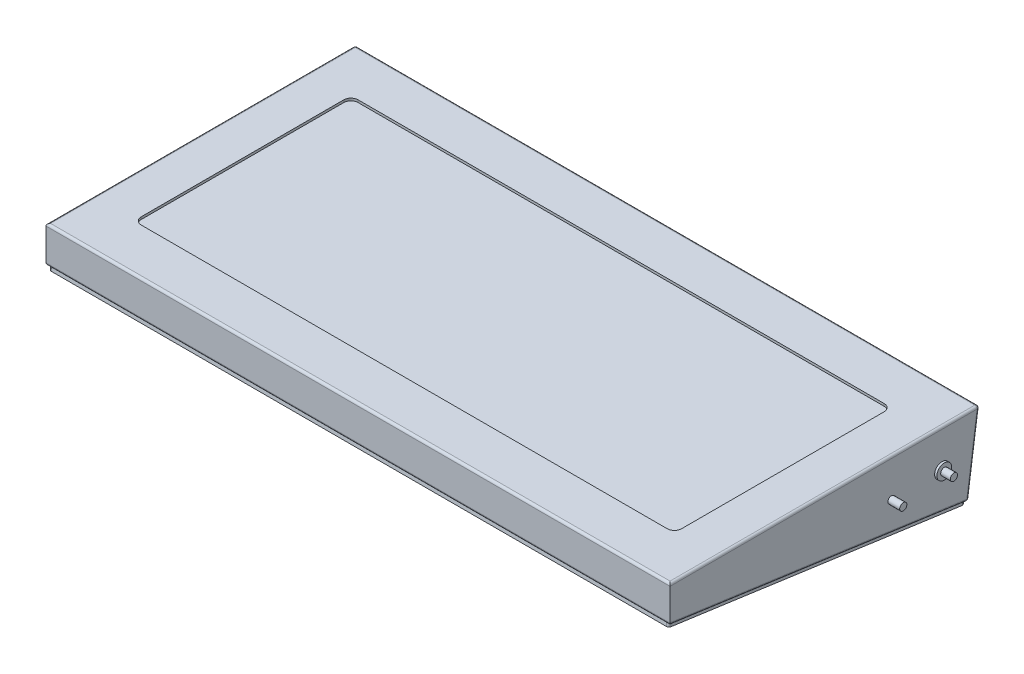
ISO-10303-21;
HEADER;
FILE_DESCRIPTION(('STEP AP214'),'2;1');
FILE_NAME('part.step','',(''),(''),'','','');
FILE_SCHEMA(('AUTOMOTIVE_DESIGN { 1 0 10303 214 1 1 1 1 }'));
ENDSEC;
DATA;
#1=APPLICATION_CONTEXT('core data for automotive mechanical design processes');
#2=APPLICATION_PROTOCOL_DEFINITION('international standard','automotive_design',2000,#1);
#3=PRODUCT_CONTEXT('',#1,'mechanical');
#4=PRODUCT('Part','Part','',(#3));
#5=PRODUCT_RELATED_PRODUCT_CATEGORY('part','',(#4));
#6=PRODUCT_DEFINITION_FORMATION('','',#4);
#7=PRODUCT_DEFINITION_CONTEXT('part definition',#1,'design');
#8=PRODUCT_DEFINITION('design','',#6,#7);
#9=PRODUCT_DEFINITION_SHAPE('','',#8);
#10=(LENGTH_UNIT() NAMED_UNIT(*) SI_UNIT(.MILLI.,.METRE.));
#11=(NAMED_UNIT(*) PLANE_ANGLE_UNIT() SI_UNIT($,.RADIAN.));
#12=(NAMED_UNIT(*) SI_UNIT($,.STERADIAN.) SOLID_ANGLE_UNIT());
#13=UNCERTAINTY_MEASURE_WITH_UNIT(LENGTH_MEASURE(1.E-05),#10,'distance_accuracy_value','');
#14=(GEOMETRIC_REPRESENTATION_CONTEXT(3) GLOBAL_UNCERTAINTY_ASSIGNED_CONTEXT((#13)) GLOBAL_UNIT_ASSIGNED_CONTEXT((#10,
#11,#12)) REPRESENTATION_CONTEXT('',''));
#15=CARTESIAN_POINT('',(0.,0.,0.));
#16=DIRECTION('',(0.,0.,1.));
#17=DIRECTION('',(1.,0.,0.));
#18=AXIS2_PLACEMENT_3D('',#15,#16,#17);
#19=CARTESIAN_POINT('',(208.28,-51.915397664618,7.2962333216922));
#20=DIRECTION('',(0.,0.990409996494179,-0.13815946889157));
#21=DIRECTION('',(0.,0.13815946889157,0.990409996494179));
#22=AXIS2_PLACEMENT_3D('',#19,#20,#21);
#23=PLANE('',#22);
#24=CARTESIAN_POINT('',(-205.232,-51.5646879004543,9.81033140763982));
#25=DIRECTION('',(0.,-0.990409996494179,0.13815946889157));
#26=DIRECTION('',(0.,-0.13815946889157,-0.990409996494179));
#27=AXIS2_PLACEMENT_3D('',#24,#25,#26);
#28=CIRCLE('',#27,1.52400000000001);
#29=CARTESIAN_POINT('',(-206.756,-51.5646879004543,9.81033140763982));
#30=VERTEX_POINT('',#29);
#31=CARTESIAN_POINT('',(-206.367921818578,-51.7050580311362,8.80407406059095));
#32=VERTEX_POINT('',#31);
#33=EDGE_CURVE('E501',#30,#32,#28,.T.);
#34=ORIENTED_EDGE('',*,*,#33,.F.);
#35=DIRECTION('',(0.,-0.13815946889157,-0.990409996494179));
#36=VECTOR('',#35,1.);
#37=CARTESIAN_POINT('',(-206.756,-51.915397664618,7.2962333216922));
#38=LINE('',#37,#36);
#39=CARTESIAN_POINT('',(-206.756,-51.7050580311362,8.80407406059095));
#40=VERTEX_POINT('',#39);
#41=EDGE_CURVE('E404',#30,#40,#38,.T.);
#42=ORIENTED_EDGE('',*,*,#41,.T.);
#43=DIRECTION('',(-1.,0.,0.));
#44=VECTOR('',#43,1.);
#45=CARTESIAN_POINT('',(208.28,-51.7050580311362,8.80407406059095));
#46=LINE('',#45,#44);
#47=EDGE_CURVE('E408',#40,#32,#46,.F.);
#48=ORIENTED_EDGE('',*,*,#47,.T.);
#49=EDGE_LOOP('',(#34,#42,#48));
#50=FACE_BOUND('',#49,.T.);
#51=ADVANCED_FACE('F34',(#50),#23,.F.);
#52=CARTESIAN_POINT('',(205.232,-51.5646879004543,9.81033140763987));
#53=DIRECTION('',(0.,-0.990409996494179,0.13815946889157));
#54=DIRECTION('',(0.,0.13815946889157,0.990409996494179));
#55=AXIS2_PLACEMENT_3D('',#52,#53,#54);
#56=CIRCLE('',#55,1.52400000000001);
#57=CARTESIAN_POINT('',(206.367921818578,-51.7050580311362,8.80407406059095));
#58=VERTEX_POINT('',#57);
#59=CARTESIAN_POINT('',(206.756,-51.5646879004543,9.81033140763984));
#60=VERTEX_POINT('',#59);
#61=EDGE_CURVE('E505',#58,#60,#56,.T.);
#62=ORIENTED_EDGE('',*,*,#61,.F.);
#63=CARTESIAN_POINT('',(206.756,-51.7050580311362,8.80407406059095));
#64=VERTEX_POINT('',#63);
#65=EDGE_CURVE('E407',#58,#64,#46,.F.);
#66=ORIENTED_EDGE('',*,*,#65,.T.);
#67=DIRECTION('',(0.,-0.13815946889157,-0.990409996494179));
#68=VECTOR('',#67,1.);
#69=CARTESIAN_POINT('',(206.756,-24.1045873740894,206.660813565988));
#70=LINE('',#69,#68);
#71=EDGE_CURVE('E398',#64,#60,#70,.F.);
#72=ORIENTED_EDGE('',*,*,#71,.T.);
#73=EDGE_LOOP('',(#62,#66,#72));
#74=FACE_BOUND('',#73,.T.);
#75=ADVANCED_FACE('F548',(#74),#23,.F.);
#76=CARTESIAN_POINT('',(205.232,-24.4300391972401,204.327779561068));
#77=DIRECTION('',(0.,-0.990409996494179,0.13815946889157));
#78=DIRECTION('',(0.,-0.13815946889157,-0.990409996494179));
#79=AXIS2_PLACEMENT_3D('',#76,#77,#78);
#80=CIRCLE('',#79,1.52400000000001);
#81=CARTESIAN_POINT('',(206.756,-24.4300391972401,204.327779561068));
#82=VERTEX_POINT('',#81);
#83=CARTESIAN_POINT('',(206.354480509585,-24.2876200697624,205.34872534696));
#84=VERTEX_POINT('',#83);
#85=EDGE_CURVE('E513',#82,#84,#80,.T.);
#86=ORIENTED_EDGE('',*,*,#85,.F.);
#87=CARTESIAN_POINT('',(206.756,-24.2876200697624,205.34872534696));
#88=VERTEX_POINT('',#87);
#89=EDGE_CURVE('E397',#82,#88,#70,.F.);
#90=ORIENTED_EDGE('',*,*,#89,.T.);
#91=DIRECTION('',(-1.,0.,0.));
#92=VECTOR('',#91,1.);
#93=CARTESIAN_POINT('',(208.28,-24.2876200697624,205.34872534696));
#94=LINE('',#93,#92);
#95=EDGE_CURVE('E402',#88,#84,#94,.T.);
#96=ORIENTED_EDGE('',*,*,#95,.T.);
#97=EDGE_LOOP('',(#86,#90,#96));
#98=FACE_BOUND('',#97,.T.);
#99=ADVANCED_FACE('F583',(#98),#23,.F.);
#100=CARTESIAN_POINT('',(-205.232,-24.4300391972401,204.327779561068));
#101=DIRECTION('',(0.,-0.990409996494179,0.13815946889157));
#102=DIRECTION('',(0.,-0.13815946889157,-0.990409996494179));
#103=AXIS2_PLACEMENT_3D('',#100,#101,#102);
#104=CIRCLE('',#103,1.52400000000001);
#105=CARTESIAN_POINT('',(-206.354480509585,-24.2876200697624,205.34872534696));
#106=VERTEX_POINT('',#105);
#107=CARTESIAN_POINT('',(-206.756,-24.4300391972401,204.327779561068));
#108=VERTEX_POINT('',#107);
#109=EDGE_CURVE('E50',#106,#108,#104,.T.);
#110=ORIENTED_EDGE('',*,*,#109,.F.);
#111=CARTESIAN_POINT('',(-206.756,-24.2876200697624,205.34872534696));
#112=VERTEX_POINT('',#111);
#113=EDGE_CURVE('E401',#106,#112,#94,.T.);
#114=ORIENTED_EDGE('',*,*,#113,.T.);
#115=EDGE_CURVE('E405',#112,#108,#38,.T.);
#116=ORIENTED_EDGE('',*,*,#115,.T.);
#117=EDGE_LOOP('',(#110,#114,#116));
#118=FACE_BOUND('',#117,.T.);
#119=ADVANCED_FACE('F592',(#118),#23,.F.);
#120=CARTESIAN_POINT('',(208.28,0.,0.));
#121=DIRECTION('',(0.,-1.,0.));
#122=DIRECTION('',(0.,0.,-1.));
#123=AXIS2_PLACEMENT_3D('',#120,#121,#122);
#124=PLANE('',#123);
#125=DIRECTION('',(1.,0.,0.));
#126=VECTOR('',#125,1.);
#127=CARTESIAN_POINT('',(-175.5648,0.,175.846542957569));
#128=LINE('',#127,#126);
#129=CARTESIAN_POINT('',(-175.5648,0.,175.846542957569));
#130=VERTEX_POINT('',#129);
#131=CARTESIAN_POINT('',(175.5648,0.,175.846542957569));
#132=VERTEX_POINT('',#131);
#133=EDGE_CURVE('E312',#130,#132,#128,.T.);
#134=ORIENTED_EDGE('',*,*,#133,.F.);
#135=CARTESIAN_POINT('',(-175.5648,0.,171.071342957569));
#136=DIRECTION('',(0.,1.,0.));
#137=DIRECTION('',(0.,0.,1.));
#138=AXIS2_PLACEMENT_3D('',#135,#136,#137);
#139=CIRCLE('',#138,4.77520000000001);
#140=CARTESIAN_POINT('',(-180.34,0.,171.071342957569));
#141=VERTEX_POINT('',#140);
#142=EDGE_CURVE('E282',#141,#130,#139,.T.);
#143=ORIENTED_EDGE('',*,*,#142,.F.);
#144=DIRECTION('',(0.,0.,1.));
#145=VECTOR('',#144,1.);
#146=CARTESIAN_POINT('',(-180.34,0.,35.8417429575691));
#147=LINE('',#146,#145);
#148=CARTESIAN_POINT('',(-180.34,0.,35.8417429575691));
#149=VERTEX_POINT('',#148);
#150=EDGE_CURVE('E289',#149,#141,#147,.T.);
#151=ORIENTED_EDGE('',*,*,#150,.F.);
#152=CARTESIAN_POINT('',(-175.5648,0.,35.8417429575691));
#153=DIRECTION('',(0.,1.,0.));
#154=DIRECTION('',(0.,0.,1.));
#155=AXIS2_PLACEMENT_3D('',#152,#153,#154);
#156=CIRCLE('',#155,4.77520000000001);
#157=CARTESIAN_POINT('',(-175.5648,0.,31.0665429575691));
#158=VERTEX_POINT('',#157);
#159=EDGE_CURVE('E327',#158,#149,#156,.T.);
#160=ORIENTED_EDGE('',*,*,#159,.F.);
#161=DIRECTION('',(-1.,0.,0.));
#162=VECTOR('',#161,1.);
#163=CARTESIAN_POINT('',(-175.5648,0.,31.0665429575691));
#164=LINE('',#163,#162);
#165=CARTESIAN_POINT('',(175.5648,0.,31.0665429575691));
#166=VERTEX_POINT('',#165);
#167=EDGE_CURVE('E324',#166,#158,#164,.T.);
#168=ORIENTED_EDGE('',*,*,#167,.F.);
#169=CARTESIAN_POINT('',(175.5648,0.,35.8417429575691));
#170=DIRECTION('',(0.,1.,0.));
#171=DIRECTION('',(0.,0.,-1.));
#172=AXIS2_PLACEMENT_3D('',#169,#170,#171);
#173=CIRCLE('',#172,4.77520000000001);
#174=CARTESIAN_POINT('',(180.34,0.,35.8417429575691));
#175=VERTEX_POINT('',#174);
#176=EDGE_CURVE('E321',#175,#166,#173,.T.);
#177=ORIENTED_EDGE('',*,*,#176,.F.);
#178=DIRECTION('',(0.,0.,-1.));
#179=VECTOR('',#178,1.);
#180=CARTESIAN_POINT('',(180.34,0.,35.8417429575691));
#181=LINE('',#180,#179);
#182=CARTESIAN_POINT('',(180.34,0.,171.071342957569));
#183=VERTEX_POINT('',#182);
#184=EDGE_CURVE('E318',#183,#175,#181,.T.);
#185=ORIENTED_EDGE('',*,*,#184,.F.);
#186=CARTESIAN_POINT('',(175.5648,0.,171.071342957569));
#187=DIRECTION('',(0.,1.,0.));
#188=DIRECTION('',(0.,0.,1.));
#189=AXIS2_PLACEMENT_3D('',#186,#187,#188);
#190=CIRCLE('',#189,4.77520000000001);
#191=EDGE_CURVE('E315',#132,#183,#190,.T.);
#192=ORIENTED_EDGE('',*,*,#191,.F.);
#193=EDGE_LOOP('',(#134,#143,#151,#160,#168,#177,#185,#192));
#194=FACE_BOUND('',#193,.T.);
#195=DIRECTION('',(0.,0.,1.));
#196=VECTOR('',#195,1.);
#197=CARTESIAN_POINT('',(206.756,0.,0.));
#198=LINE('',#197,#196);
#199=CARTESIAN_POINT('',(206.756,0.,205.159924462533));
#200=VERTEX_POINT('',#199);
#201=CARTESIAN_POINT('',(206.756,0.,1.75316145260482));
#202=VERTEX_POINT('',#201);
#203=EDGE_CURVE('E362',#200,#202,#198,.F.);
#204=ORIENTED_EDGE('',*,*,#203,.T.);
#205=DIRECTION('',(-1.,0.,0.));
#206=VECTOR('',#205,1.);
#207=CARTESIAN_POINT('',(208.28,0.,1.75316145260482));
#208=LINE('',#207,#206);
#209=CARTESIAN_POINT('',(-206.756,0.,1.75316145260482));
#210=VERTEX_POINT('',#209);
#211=EDGE_CURVE('E364',#202,#210,#208,.T.);
#212=ORIENTED_EDGE('',*,*,#211,.T.);
#213=DIRECTION('',(0.,0.,1.));
#214=VECTOR('',#213,1.);
#215=CARTESIAN_POINT('',(-206.756,0.,0.));
#216=LINE('',#215,#214);
#217=CARTESIAN_POINT('',(-206.756,0.,205.159924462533));
#218=VERTEX_POINT('',#217);
#219=EDGE_CURVE('E358',#210,#218,#216,.T.);
#220=ORIENTED_EDGE('',*,*,#219,.T.);
#221=DIRECTION('',(-1.,0.,0.));
#222=VECTOR('',#221,1.);
#223=CARTESIAN_POINT('',(208.28,0.,205.159924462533));
#224=LINE('',#223,#222);
#225=EDGE_CURVE('E360',#218,#200,#224,.F.);
#226=ORIENTED_EDGE('',*,*,#225,.T.);
#227=EDGE_LOOP('',(#204,#212,#220,#226));
#228=FACE_BOUND('',#227,.T.);
#229=ADVANCED_FACE('F594',(#194,#228),#124,.F.);
#230=CARTESIAN_POINT('',(208.28,0.,206.685485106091));
#231=DIRECTION('',(0.,0.00102351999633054,-0.999999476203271));
#232=DIRECTION('',(0.,0.999999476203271,0.00102351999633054));
#233=AXIS2_PLACEMENT_3D('',#230,#231,#232);
#234=PLANE('',#233);
#235=DIRECTION('',(0.,-0.999999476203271,-0.00102351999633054));
#236=VECTOR('',#235,1.);
#237=CARTESIAN_POINT('',(208.28,0.,206.685485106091));
#238=LINE('',#237,#236);
#239=CARTESIAN_POINT('',(208.28,-1.52555984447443,206.683923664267));
#240=VERTEX_POINT('',#239);
#241=CARTESIAN_POINT('',(208.28,-22.5656109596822,206.662388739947));
#242=VERTEX_POINT('',#241);
#243=EDGE_CURVE('E349',#240,#242,#238,.T.);
#244=ORIENTED_EDGE('',*,*,#243,.F.);
#245=DIRECTION('',(-1.,0.,0.));
#246=VECTOR('',#245,1.);
#247=CARTESIAN_POINT('',(208.28,-1.52555984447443,206.683923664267));
#248=LINE('',#247,#246);
#249=CARTESIAN_POINT('',(-208.28,-1.52555984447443,206.683923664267));
#250=VERTEX_POINT('',#249);
#251=EDGE_CURVE('E389',#240,#250,#248,.T.);
#252=ORIENTED_EDGE('',*,*,#251,.T.);
#253=DIRECTION('',(0.,-0.999999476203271,-0.00102351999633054));
#254=VECTOR('',#253,1.);
#255=CARTESIAN_POINT('',(-208.28,0.,206.685485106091));
#256=LINE('',#255,#254);
#257=CARTESIAN_POINT('',(-208.28,-22.5656109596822,206.662388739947));
#258=VERTEX_POINT('',#257);
#259=EDGE_CURVE('E354',#250,#258,#256,.T.);
#260=ORIENTED_EDGE('',*,*,#259,.T.);
#261=CARTESIAN_POINT('',(-206.756,-22.5656109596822,206.662388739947));
#262=DIRECTION('',(0.,0.00102351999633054,-0.999999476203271));
#263=DIRECTION('',(0.,-0.999999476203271,-0.00102351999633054));
#264=AXIS2_PLACEMENT_3D('',#261,#262,#263);
#265=ELLIPSE('',#264,1.53897722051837,1.524);
#266=CARTESIAN_POINT('',(-208.265168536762,-22.7797950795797,206.662169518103));
#267=VERTEX_POINT('',#266);
#268=EDGE_CURVE('E387',#258,#267,#265,.F.);
#269=ORIENTED_EDGE('',*,*,#268,.T.);
#270=DIRECTION('',(-1.,0.,0.));
#271=VECTOR('',#270,1.);
#272=CARTESIAN_POINT('',(208.28,-22.7797950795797,206.662169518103));
#273=LINE('',#272,#271);
#274=CARTESIAN_POINT('',(208.265168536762,-22.7797950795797,206.662169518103));
#275=VERTEX_POINT('',#274);
#276=EDGE_CURVE('E385',#267,#275,#273,.F.);
#277=ORIENTED_EDGE('',*,*,#276,.T.);
#278=CARTESIAN_POINT('',(206.756,-22.5656109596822,206.662388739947));
#279=DIRECTION('',(0.,0.00102351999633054,-0.999999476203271));
#280=DIRECTION('',(0.,0.999999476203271,0.00102351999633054));
#281=AXIS2_PLACEMENT_3D('',#278,#279,#280);
#282=ELLIPSE('',#281,1.53897722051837,1.524);
#283=EDGE_CURVE('E383',#275,#242,#282,.F.);
#284=ORIENTED_EDGE('',*,*,#283,.T.);
#285=EDGE_LOOP('',(#244,#252,#260,#269,#277,#284));
#286=FACE_BOUND('',#285,.T.);
#287=ADVANCED_FACE('F600',(#286),#234,.F.);
#288=CARTESIAN_POINT('',(208.28,-51.915397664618,7.2962333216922));
#289=DIRECTION('',(0.,0.139173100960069,0.99026806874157));
#290=DIRECTION('',(0.,-0.99026806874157,0.139173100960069));
#291=AXIS2_PLACEMENT_3D('',#288,#289,#290);
#292=PLANE('',#291);
#293=DIRECTION('',(-1.,0.,0.));
#294=VECTOR('',#293,1.);
#295=CARTESIAN_POINT('',(208.28,-50.4077730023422,7.08435049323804));
#296=LINE('',#295,#294);
#297=CARTESIAN_POINT('',(206.756,-50.4077730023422,7.08435049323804));
#298=VERTEX_POINT('',#297);
#299=CARTESIAN_POINT('',(-206.756,-50.4077730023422,7.08435049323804));
#300=VERTEX_POINT('',#299);
#301=EDGE_CURVE('E369',#298,#300,#296,.T.);
#302=ORIENTED_EDGE('',*,*,#301,.T.);
#303=DIRECTION('',(0.,0.99026806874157,-0.139173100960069));
#304=VECTOR('',#303,1.);
#305=CARTESIAN_POINT('',(-206.756,-51.915397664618,7.2962333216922));
#306=LINE('',#305,#304);
#307=CARTESIAN_POINT('',(-206.756,-1.73609980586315,0.243992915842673));
#308=VERTEX_POINT('',#307);
#309=EDGE_CURVE('E374',#300,#308,#306,.T.);
#310=ORIENTED_EDGE('',*,*,#309,.T.);
#311=DIRECTION('',(-1.,0.,0.));
#312=VECTOR('',#311,1.);
#313=CARTESIAN_POINT('',(208.28,-1.73609980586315,0.243992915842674));
#314=LINE('',#313,#312);
#315=CARTESIAN_POINT('',(206.756,-1.73609980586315,0.243992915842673));
#316=VERTEX_POINT('',#315);
#317=EDGE_CURVE('E371',#308,#316,#314,.F.);
#318=ORIENTED_EDGE('',*,*,#317,.T.);
#319=DIRECTION('',(0.,0.99026806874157,-0.139173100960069));
#320=VECTOR('',#319,1.);
#321=CARTESIAN_POINT('',(206.756,-51.915397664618,7.2962333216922));
#322=LINE('',#321,#320);
#323=EDGE_CURVE('E367',#316,#298,#322,.F.);
#324=ORIENTED_EDGE('',*,*,#323,.T.);
#325=EDGE_LOOP('',(#302,#310,#318,#324));
#326=FACE_BOUND('',#325,.T.);
#327=ADVANCED_FACE('F805',(#326),#292,.F.);
#328=CARTESIAN_POINT('',(208.28,0.,0.));
#329=DIRECTION('',(1.,0.,0.));
#330=DIRECTION('',(0.,0.,-1.));
#331=AXIS2_PLACEMENT_3D('',#328,#329,#330);
#332=PLANE('',#331);
#333=CARTESIAN_POINT('',(208.28,-25.146,25.146));
#334=DIRECTION('',(1.,0.,0.));
#335=DIRECTION('',(0.,0.,-1.));
#336=AXIS2_PLACEMENT_3D('',#333,#334,#335);
#337=CIRCLE('',#336,4.953);
#338=CARTESIAN_POINT('',(208.28,-25.146,30.099));
#339=VERTEX_POINT('',#338);
#340=EDGE_CURVE('E468',#339,#339,#337,.T.);
#341=ORIENTED_EDGE('',*,*,#340,.F.);
#342=EDGE_LOOP('',(#341));
#343=FACE_BOUND('',#342,.T.);
#344=CARTESIAN_POINT('',(208.28,-25.4,58.928));
#345=DIRECTION('',(1.,0.,0.));
#346=DIRECTION('',(0.,0.,-1.));
#347=AXIS2_PLACEMENT_3D('',#344,#345,#346);
#348=CIRCLE('',#347,2.3876);
#349=CARTESIAN_POINT('',(208.28,-25.4,56.5404));
#350=VERTEX_POINT('',#349);
#351=EDGE_CURVE('E278',#350,#350,#348,.T.);
#352=ORIENTED_EDGE('',*,*,#351,.F.);
#353=EDGE_LOOP('',(#352));
#354=FACE_BOUND('',#353,.T.);
#355=DIRECTION('',(0.,0.99026806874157,-0.139173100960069));
#356=VECTOR('',#355,1.);
#357=CARTESIAN_POINT('',(208.28,0.212099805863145,1.50916853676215));
#358=LINE('',#357,#356);
#359=CARTESIAN_POINT('',(208.28,-50.1956731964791,8.59351903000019));
#360=VERTEX_POINT('',#359);
#361=CARTESIAN_POINT('',(208.28,-1.524,1.75316145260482));
#362=VERTEX_POINT('',#361);
#363=EDGE_CURVE('E378',#360,#362,#358,.T.);
#364=ORIENTED_EDGE('',*,*,#363,.T.);
#365=DIRECTION('',(0.,0.,1.));
#366=VECTOR('',#365,1.);
#367=CARTESIAN_POINT('',(208.28,-1.52400000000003,206.685485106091));
#368=LINE('',#367,#366);
#369=CARTESIAN_POINT('',(208.28,-1.52400000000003,206.6839252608));
#370=VERTEX_POINT('',#369);
#371=EDGE_CURVE('E380',#362,#370,#368,.T.);
#372=ORIENTED_EDGE('',*,*,#371,.T.);
#373=EDGE_CURVE('E352',#370,#240,#238,.T.);
#374=ORIENTED_EDGE('',*,*,#373,.T.);
#375=ORIENTED_EDGE('',*,*,#243,.T.);
#376=DIRECTION('',(0.,-0.13815946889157,-0.990409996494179));
#377=VECTOR('',#376,1.);
#378=CARTESIAN_POINT('',(208.28,-50.4060128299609,7.08567829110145));
#379=LINE('',#378,#377);
#380=EDGE_CURVE('E376',#242,#360,#379,.T.);
#381=ORIENTED_EDGE('',*,*,#380,.T.);
#382=EDGE_LOOP('',(#364,#372,#374,#375,#381));
#383=FACE_BOUND('',#382,.T.);
#384=ADVANCED_FACE('F801',(#343,#354,#383),#332,.T.);
#385=CARTESIAN_POINT('',(-208.28,0.,0.));
#386=DIRECTION('',(1.,0.,0.));
#387=DIRECTION('',(0.,0.,-1.));
#388=AXIS2_PLACEMENT_3D('',#385,#386,#387);
#389=PLANE('',#388);
#390=CARTESIAN_POINT('',(-208.28,-25.146,25.146));
#391=DIRECTION('',(1.,0.,0.));
#392=DIRECTION('',(0.,0.,-1.));
#393=AXIS2_PLACEMENT_3D('',#390,#391,#392);
#394=CIRCLE('',#393,17.526);
#395=CARTESIAN_POINT('',(-208.28,-25.146,7.62));
#396=VERTEX_POINT('',#395);
#397=EDGE_CURVE('E11',#396,#396,#394,.F.);
#398=ORIENTED_EDGE('',*,*,#397,.F.);
#399=EDGE_LOOP('',(#398));
#400=FACE_BOUND('',#399,.T.);
#401=CARTESIAN_POINT('',(-208.28,-25.4,58.928));
#402=DIRECTION('',(1.,0.,0.));
#403=DIRECTION('',(0.,0.,-1.));
#404=AXIS2_PLACEMENT_3D('',#401,#402,#403);
#405=CIRCLE('',#404,2.3876);
#406=CARTESIAN_POINT('',(-208.28,-25.4,56.5404));
#407=VERTEX_POINT('',#406);
#408=EDGE_CURVE('E269',#407,#407,#405,.T.);
#409=ORIENTED_EDGE('',*,*,#408,.T.);
#410=EDGE_LOOP('',(#409));
#411=FACE_BOUND('',#410,.T.);
#412=CARTESIAN_POINT('',(-208.28,-1.52400000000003,206.6839252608));
#413=VERTEX_POINT('',#412);
#414=EDGE_CURVE('E353',#413,#250,#256,.T.);
#415=ORIENTED_EDGE('',*,*,#414,.F.);
#416=DIRECTION('',(0.,0.,1.));
#417=VECTOR('',#416,1.);
#418=CARTESIAN_POINT('',(-208.28,-1.524,0.));
#419=LINE('',#418,#417);
#420=CARTESIAN_POINT('',(-208.28,-1.524,1.75316145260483));
#421=VERTEX_POINT('',#420);
#422=EDGE_CURVE('E395',#413,#421,#419,.F.);
#423=ORIENTED_EDGE('',*,*,#422,.T.);
#424=DIRECTION('',(0.,0.99026806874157,-0.139173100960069));
#425=VECTOR('',#424,1.);
#426=CARTESIAN_POINT('',(-208.28,0.212099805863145,1.50916853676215));
#427=LINE('',#426,#425);
#428=CARTESIAN_POINT('',(-208.28,-50.1956731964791,8.5935190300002));
#429=VERTEX_POINT('',#428);
#430=EDGE_CURVE('E393',#421,#429,#427,.F.);
#431=ORIENTED_EDGE('',*,*,#430,.T.);
#432=DIRECTION('',(0.,-0.13815946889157,-0.990409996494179));
#433=VECTOR('',#432,1.);
#434=CARTESIAN_POINT('',(-208.28,-50.4134262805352,7.03253422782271));
#435=LINE('',#434,#433);
#436=EDGE_CURVE('E391',#429,#258,#435,.F.);
#437=ORIENTED_EDGE('',*,*,#436,.T.);
#438=ORIENTED_EDGE('',*,*,#259,.F.);
#439=EDGE_LOOP('',(#415,#423,#431,#437,#438));
#440=FACE_BOUND('',#439,.T.);
#441=ADVANCED_FACE('F629',(#400,#411,#440),#389,.F.);
#442=CARTESIAN_POINT('',(208.28,-22.7782352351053,205.138170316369));
#443=DIRECTION('',(-1.,0.,0.));
#444=DIRECTION('',(0.,0.,1.));
#445=AXIS2_PLACEMENT_3D('',#442,#443,#444);
#446=CYLINDRICAL_SURFACE('',#445,1.524);
#447=CARTESIAN_POINT('',(-206.756,-22.7782352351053,205.138170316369));
#448=DIRECTION('',(-0.707106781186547,-0.0976934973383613,-0.700325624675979));
#449=DIRECTION('',(-0.707106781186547,0.0976934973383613,0.700325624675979));
#450=AXIS2_PLACEMENT_3D('',#447,#448,#449);
#451=ELLIPSE('',#450,2.1552614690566,1.524);
#452=EDGE_CURVE('E450',#112,#267,#451,.T.);
#453=ORIENTED_EDGE('',*,*,#452,.F.);
#454=ORIENTED_EDGE('',*,*,#113,.F.);
#455=DIRECTION('',(-1.,0.,0.));
#456=VECTOR('',#455,1.);
#457=CARTESIAN_POINT('',(208.28,-24.2876200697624,205.34872534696));
#458=LINE('',#457,#456);
#459=EDGE_CURVE('E57',#106,#84,#458,.F.);
#460=ORIENTED_EDGE('',*,*,#459,.T.);
#461=ORIENTED_EDGE('',*,*,#95,.F.);
#462=CARTESIAN_POINT('',(206.756,-22.7782352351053,205.138170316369));
#463=DIRECTION('',(-0.707106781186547,0.0976934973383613,0.700325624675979));
#464=DIRECTION('',(0.707106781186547,0.0976934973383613,0.700325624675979));
#465=AXIS2_PLACEMENT_3D('',#462,#463,#464);
#466=ELLIPSE('',#465,2.1552614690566,1.524);
#467=EDGE_CURVE('E357',#275,#88,#466,.F.);
#468=ORIENTED_EDGE('',*,*,#467,.F.);
#469=ORIENTED_EDGE('',*,*,#276,.F.);
#470=EDGE_LOOP('',(#453,#454,#460,#461,#468,#469));
#471=FACE_BOUND('',#470,.T.);
#472=ADVANCED_FACE('F36',(#471),#446,.T.);
#473=CARTESIAN_POINT('',(206.756,-50.4134262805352,7.03253422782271));
#474=DIRECTION('',(0.,0.13815946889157,0.990409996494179));
#475=DIRECTION('',(0.,-0.990409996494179,0.13815946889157));
#476=AXIS2_PLACEMENT_3D('',#473,#474,#475);
#477=CYLINDRICAL_SURFACE('',#476,1.524);
#478=ORIENTED_EDGE('',*,*,#467,.T.);
#479=ORIENTED_EDGE('',*,*,#89,.F.);
#480=DIRECTION('',(0.,0.13815946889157,0.990409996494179));
#481=VECTOR('',#480,1.);
#482=CARTESIAN_POINT('',(206.756,-24.4300391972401,204.327779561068));
#483=LINE('',#482,#481);
#484=EDGE_CURVE('E509',#60,#82,#483,.T.);
#485=ORIENTED_EDGE('',*,*,#484,.F.);
#486=ORIENTED_EDGE('',*,*,#71,.F.);
#487=CARTESIAN_POINT('',(206.756,-50.1956731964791,8.59351903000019));
#488=DIRECTION('',(0.,-0.138159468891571,-0.990409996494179));
#489=DIRECTION('',(0.,0.990409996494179,-0.138159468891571));
#490=AXIS2_PLACEMENT_3D('',#487,#488,#489);
#491=CIRCLE('',#490,1.524);
#492=EDGE_CURVE('E444',#360,#64,#491,.T.);
#493=ORIENTED_EDGE('',*,*,#492,.F.);
#494=ORIENTED_EDGE('',*,*,#380,.F.);
#495=ORIENTED_EDGE('',*,*,#283,.F.);
#496=EDGE_LOOP('',(#478,#479,#485,#486,#493,#494,#495));
#497=FACE_BOUND('',#496,.T.);
#498=ADVANCED_FACE('F585',(#497),#477,.T.);
#499=CARTESIAN_POINT('',(-206.756,-50.4060128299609,7.08567829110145));
#500=DIRECTION('',(0.,-0.13815946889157,-0.990409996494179));
#501=DIRECTION('',(0.,0.990409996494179,-0.13815946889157));
#502=AXIS2_PLACEMENT_3D('',#499,#500,#501);
#503=CYLINDRICAL_SURFACE('',#502,1.524);
#504=ORIENTED_EDGE('',*,*,#268,.F.);
#505=ORIENTED_EDGE('',*,*,#436,.F.);
#506=CARTESIAN_POINT('',(-206.756,-50.1956731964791,8.5935190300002));
#507=DIRECTION('',(0.,-0.13815946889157,-0.990409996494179));
#508=DIRECTION('',(0.,0.990409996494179,-0.13815946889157));
#509=AXIS2_PLACEMENT_3D('',#506,#507,#508);
#510=CIRCLE('',#509,1.524);
#511=EDGE_CURVE('E441',#40,#429,#510,.T.);
#512=ORIENTED_EDGE('',*,*,#511,.F.);
#513=ORIENTED_EDGE('',*,*,#41,.F.);
#514=DIRECTION('',(0.,-0.13815946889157,-0.990409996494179));
#515=VECTOR('',#514,1.);
#516=CARTESIAN_POINT('',(-206.756,-51.5646879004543,9.81033140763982));
#517=LINE('',#516,#515);
#518=EDGE_CURVE('E253',#108,#30,#517,.T.);
#519=ORIENTED_EDGE('',*,*,#518,.F.);
#520=ORIENTED_EDGE('',*,*,#115,.F.);
#521=ORIENTED_EDGE('',*,*,#452,.T.);
#522=EDGE_LOOP('',(#504,#505,#512,#513,#519,#520,#521));
#523=FACE_BOUND('',#522,.T.);
#524=ADVANCED_FACE('F562',(#523),#503,.T.);
#525=CARTESIAN_POINT('',(208.28,-50.1956731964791,8.5935190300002));
#526=DIRECTION('',(-1.,0.,0.));
#527=DIRECTION('',(0.,0.,1.));
#528=AXIS2_PLACEMENT_3D('',#525,#526,#527);
#529=CYLINDRICAL_SURFACE('',#528,1.524);
#530=CARTESIAN_POINT('',(206.756,-50.1956731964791,8.5935190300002));
#531=DIRECTION('',(1.,0.,0.));
#532=DIRECTION('',(0.,0.,-1.));
#533=AXIS2_PLACEMENT_3D('',#530,#531,#532);
#534=CIRCLE('',#533,1.524);
#535=EDGE_CURVE('E447',#64,#298,#534,.T.);
#536=ORIENTED_EDGE('',*,*,#535,.F.);
#537=ORIENTED_EDGE('',*,*,#65,.F.);
#538=EDGE_CURVE('E411',#32,#58,#46,.F.);
#539=ORIENTED_EDGE('',*,*,#538,.F.);
#540=ORIENTED_EDGE('',*,*,#47,.F.);
#541=CARTESIAN_POINT('',(-206.756,-50.1956731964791,8.5935190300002));
#542=DIRECTION('',(-1.,0.,0.));
#543=DIRECTION('',(0.,0.,1.));
#544=AXIS2_PLACEMENT_3D('',#541,#542,#543);
#545=CIRCLE('',#544,1.524);
#546=EDGE_CURVE('E438',#300,#40,#545,.T.);
#547=ORIENTED_EDGE('',*,*,#546,.F.);
#548=ORIENTED_EDGE('',*,*,#301,.F.);
#549=EDGE_LOOP('',(#536,#537,#539,#540,#547,#548));
#550=FACE_BOUND('',#549,.T.);
#551=ADVANCED_FACE('F555',(#550),#529,.T.);
#552=CARTESIAN_POINT('',(206.756,-50.1956731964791,8.5935190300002));
#553=DIRECTION('',(0.,0.,1.));
#554=DIRECTION('',(1.,0.,0.));
#555=AXIS2_PLACEMENT_3D('',#552,#553,#554);
#556=SPHERICAL_SURFACE('',#555,1.524);
#557=ORIENTED_EDGE('',*,*,#492,.T.);
#558=ORIENTED_EDGE('',*,*,#535,.T.);
#559=CARTESIAN_POINT('',(206.756,-50.1956731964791,8.5935190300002));
#560=DIRECTION('',(0.,-0.99026806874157,0.13917310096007));
#561=DIRECTION('',(0.,-0.13917310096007,-0.99026806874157));
#562=AXIS2_PLACEMENT_3D('',#559,#560,#561);
#563=CIRCLE('',#562,1.524);
#564=EDGE_CURVE('E435',#360,#298,#563,.F.);
#565=ORIENTED_EDGE('',*,*,#564,.F.);
#566=EDGE_LOOP('',(#557,#558,#565));
#567=FACE_BOUND('',#566,.T.);
#568=ADVANCED_FACE('F654',(#567),#556,.T.);
#569=CARTESIAN_POINT('',(208.28,-1.52400000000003,205.159924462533));
#570=DIRECTION('',(-1.,0.,0.));
#571=DIRECTION('',(0.,0.,1.));
#572=AXIS2_PLACEMENT_3D('',#569,#570,#571);
#573=CYLINDRICAL_SURFACE('',#572,1.524);
#574=ORIENTED_EDGE('',*,*,#251,.F.);
#575=ORIENTED_EDGE('',*,*,#373,.F.);
#576=CARTESIAN_POINT('',(206.756,-1.52400000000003,205.159924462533));
#577=DIRECTION('',(-0.707106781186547,0.,0.707106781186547));
#578=DIRECTION('',(-0.707106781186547,0.,-0.707106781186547));
#579=AXIS2_PLACEMENT_3D('',#576,#577,#578);
#580=ELLIPSE('',#579,2.1552614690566,1.524);
#581=EDGE_CURVE('E433',#200,#370,#580,.F.);
#582=ORIENTED_EDGE('',*,*,#581,.F.);
#583=ORIENTED_EDGE('',*,*,#225,.F.);
#584=CARTESIAN_POINT('',(-206.756,-1.52400000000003,205.159924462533));
#585=DIRECTION('',(0.707106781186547,0.,0.707106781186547));
#586=DIRECTION('',(-0.707106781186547,0.,0.707106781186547));
#587=AXIS2_PLACEMENT_3D('',#584,#585,#586);
#588=ELLIPSE('',#587,2.1552614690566,1.524);
#589=EDGE_CURVE('E430',#413,#218,#588,.F.);
#590=ORIENTED_EDGE('',*,*,#589,.F.);
#591=ORIENTED_EDGE('',*,*,#414,.T.);
#592=EDGE_LOOP('',(#574,#575,#582,#583,#590,#591));
#593=FACE_BOUND('',#592,.T.);
#594=ADVANCED_FACE('F1005',(#593),#573,.T.);
#595=CARTESIAN_POINT('',(-206.756,-50.1956731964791,8.5935190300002));
#596=DIRECTION('',(0.,0.,1.));
#597=DIRECTION('',(1.,0.,0.));
#598=AXIS2_PLACEMENT_3D('',#595,#596,#597);
#599=SPHERICAL_SURFACE('',#598,1.524);
#600=ORIENTED_EDGE('',*,*,#546,.T.);
#601=ORIENTED_EDGE('',*,*,#511,.T.);
#602=CARTESIAN_POINT('',(-206.756,-50.1956731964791,8.5935190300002));
#603=DIRECTION('',(0.,-0.99026806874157,0.13917310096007));
#604=DIRECTION('',(0.,-0.13917310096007,-0.99026806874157));
#605=AXIS2_PLACEMENT_3D('',#602,#603,#604);
#606=CIRCLE('',#605,1.524);
#607=EDGE_CURVE('E427',#300,#429,#606,.F.);
#608=ORIENTED_EDGE('',*,*,#607,.F.);
#609=EDGE_LOOP('',(#600,#601,#608));
#610=FACE_BOUND('',#609,.T.);
#611=ADVANCED_FACE('F963',(#610),#599,.T.);
#612=CARTESIAN_POINT('',(206.756,0.212099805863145,1.50916853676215));
#613=DIRECTION('',(0.,-0.99026806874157,0.139173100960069));
#614=DIRECTION('',(0.,-0.139173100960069,-0.99026806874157));
#615=AXIS2_PLACEMENT_3D('',#612,#613,#614);
#616=CYLINDRICAL_SURFACE('',#615,1.524);
#617=ORIENTED_EDGE('',*,*,#564,.T.);
#618=ORIENTED_EDGE('',*,*,#323,.F.);
#619=CARTESIAN_POINT('',(206.756,-1.524,1.75316145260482));
#620=DIRECTION('',(0.,0.99026806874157,-0.139173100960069));
#621=DIRECTION('',(0.,0.139173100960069,0.99026806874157));
#622=AXIS2_PLACEMENT_3D('',#619,#620,#621);
#623=CIRCLE('',#622,1.524);
#624=EDGE_CURVE('E424',#362,#316,#623,.T.);
#625=ORIENTED_EDGE('',*,*,#624,.F.);
#626=ORIENTED_EDGE('',*,*,#363,.F.);
#627=EDGE_LOOP('',(#617,#618,#625,#626));
#628=FACE_BOUND('',#627,.T.);
#629=ADVANCED_FACE('F993',(#628),#616,.T.);
#630=CARTESIAN_POINT('',(206.756,-1.524,0.));
#631=DIRECTION('',(0.,0.,-1.));
#632=DIRECTION('',(0.,1.,0.));
#633=AXIS2_PLACEMENT_3D('',#630,#631,#632);
#634=CYLINDRICAL_SURFACE('',#633,1.524);
#635=ORIENTED_EDGE('',*,*,#581,.T.);
#636=ORIENTED_EDGE('',*,*,#371,.F.);
#637=CARTESIAN_POINT('',(206.756,-1.524,1.75316145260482));
#638=DIRECTION('',(0.,0.,-1.));
#639=DIRECTION('',(-1.,0.,0.));
#640=AXIS2_PLACEMENT_3D('',#637,#638,#639);
#641=CIRCLE('',#640,1.524);
#642=EDGE_CURVE('E421',#202,#362,#641,.T.);
#643=ORIENTED_EDGE('',*,*,#642,.F.);
#644=ORIENTED_EDGE('',*,*,#203,.F.);
#645=EDGE_LOOP('',(#635,#636,#643,#644));
#646=FACE_BOUND('',#645,.T.);
#647=ADVANCED_FACE('F987',(#646),#634,.T.);
#648=CARTESIAN_POINT('',(-206.756,-1.524,0.));
#649=DIRECTION('',(0.,0.,1.));
#650=DIRECTION('',(0.,-1.,0.));
#651=AXIS2_PLACEMENT_3D('',#648,#649,#650);
#652=CYLINDRICAL_SURFACE('',#651,1.524);
#653=ORIENTED_EDGE('',*,*,#589,.T.);
#654=ORIENTED_EDGE('',*,*,#219,.F.);
#655=CARTESIAN_POINT('',(-206.756,-1.524,1.75316145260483));
#656=DIRECTION('',(0.,0.,-1.));
#657=DIRECTION('',(0.,1.,0.));
#658=AXIS2_PLACEMENT_3D('',#655,#656,#657);
#659=CIRCLE('',#658,1.524);
#660=EDGE_CURVE('E418',#421,#210,#659,.T.);
#661=ORIENTED_EDGE('',*,*,#660,.F.);
#662=ORIENTED_EDGE('',*,*,#422,.F.);
#663=EDGE_LOOP('',(#653,#654,#661,#662));
#664=FACE_BOUND('',#663,.T.);
#665=ADVANCED_FACE('F978',(#664),#652,.T.);
#666=CARTESIAN_POINT('',(-206.756,-51.7032978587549,8.80540185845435));
#667=DIRECTION('',(0.,0.99026806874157,-0.139173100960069));
#668=DIRECTION('',(0.,0.139173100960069,0.99026806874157));
#669=AXIS2_PLACEMENT_3D('',#666,#667,#668);
#670=CYLINDRICAL_SURFACE('',#669,1.524);
#671=ORIENTED_EDGE('',*,*,#607,.T.);
#672=ORIENTED_EDGE('',*,*,#430,.F.);
#673=CARTESIAN_POINT('',(-206.756,-1.524,1.75316145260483));
#674=DIRECTION('',(0.,0.99026806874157,-0.139173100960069));
#675=DIRECTION('',(0.,0.139173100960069,0.99026806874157));
#676=AXIS2_PLACEMENT_3D('',#673,#674,#675);
#677=CIRCLE('',#676,1.524);
#678=EDGE_CURVE('E415',#308,#421,#677,.T.);
#679=ORIENTED_EDGE('',*,*,#678,.F.);
#680=ORIENTED_EDGE('',*,*,#309,.F.);
#681=EDGE_LOOP('',(#671,#672,#679,#680));
#682=FACE_BOUND('',#681,.T.);
#683=ADVANCED_FACE('F966',(#682),#670,.T.);
#684=CARTESIAN_POINT('',(206.756,-1.524,1.75316145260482));
#685=DIRECTION('',(0.,0.,1.));
#686=DIRECTION('',(1.,0.,0.));
#687=AXIS2_PLACEMENT_3D('',#684,#685,#686);
#688=SPHERICAL_SURFACE('',#687,1.524);
#689=ORIENTED_EDGE('',*,*,#642,.T.);
#690=ORIENTED_EDGE('',*,*,#624,.T.);
#691=CARTESIAN_POINT('',(206.756,-1.524,1.75316145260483));
#692=DIRECTION('',(1.,0.,0.));
#693=DIRECTION('',(0.,0.,-1.));
#694=AXIS2_PLACEMENT_3D('',#691,#692,#693);
#695=CIRCLE('',#694,1.524);
#696=EDGE_CURVE('E413',#202,#316,#695,.F.);
#697=ORIENTED_EDGE('',*,*,#696,.F.);
#698=EDGE_LOOP('',(#689,#690,#697));
#699=FACE_BOUND('',#698,.T.);
#700=ADVANCED_FACE('F990',(#699),#688,.T.);
#701=CARTESIAN_POINT('',(-206.756,-1.524,1.75316145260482));
#702=DIRECTION('',(0.,0.,1.));
#703=DIRECTION('',(1.,0.,0.));
#704=AXIS2_PLACEMENT_3D('',#701,#702,#703);
#705=SPHERICAL_SURFACE('',#704,1.524);
#706=ORIENTED_EDGE('',*,*,#678,.T.);
#707=ORIENTED_EDGE('',*,*,#660,.T.);
#708=CARTESIAN_POINT('',(-206.756,-1.524,1.75316145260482));
#709=DIRECTION('',(-1.,0.,0.));
#710=DIRECTION('',(0.,0.,1.));
#711=AXIS2_PLACEMENT_3D('',#708,#709,#710);
#712=CIRCLE('',#711,1.524);
#713=EDGE_CURVE('E334',#308,#210,#712,.F.);
#714=ORIENTED_EDGE('',*,*,#713,.F.);
#715=EDGE_LOOP('',(#706,#707,#714));
#716=FACE_BOUND('',#715,.T.);
#717=ADVANCED_FACE('F974',(#716),#705,.T.);
#718=CARTESIAN_POINT('',(208.28,-1.524,1.75316145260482));
#719=DIRECTION('',(-1.,0.,0.));
#720=DIRECTION('',(0.,0.,1.));
#721=AXIS2_PLACEMENT_3D('',#718,#719,#720);
#722=CYLINDRICAL_SURFACE('',#721,1.524);
#723=ORIENTED_EDGE('',*,*,#696,.T.);
#724=ORIENTED_EDGE('',*,*,#317,.F.);
#725=ORIENTED_EDGE('',*,*,#713,.T.);
#726=ORIENTED_EDGE('',*,*,#211,.F.);
#727=EDGE_LOOP('',(#723,#724,#725,#726));
#728=FACE_BOUND('',#727,.T.);
#729=ADVANCED_FACE('F951',(#728),#722,.T.);
#730=CARTESIAN_POINT('',(-175.5648,-1.60020000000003,171.071342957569));
#731=DIRECTION('',(0.,1.,0.));
#732=DIRECTION('',(0.,0.,1.));
#733=AXIS2_PLACEMENT_3D('',#730,#731,#732);
#734=CYLINDRICAL_SURFACE('',#733,4.77520000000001);
#735=ORIENTED_EDGE('',*,*,#142,.T.);
#736=DIRECTION('',(0.,1.,0.));
#737=VECTOR('',#736,1.);
#738=CARTESIAN_POINT('',(-175.5648,-1.60020000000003,175.846542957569));
#739=LINE('',#738,#737);
#740=CARTESIAN_POINT('',(-175.5648,-1.60020000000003,175.846542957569));
#741=VERTEX_POINT('',#740);
#742=EDGE_CURVE('E310',#741,#130,#739,.T.);
#743=ORIENTED_EDGE('',*,*,#742,.F.);
#744=CARTESIAN_POINT('',(-175.5648,-1.60020000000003,171.071342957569));
#745=DIRECTION('',(0.,1.,0.));
#746=DIRECTION('',(0.,0.,1.));
#747=AXIS2_PLACEMENT_3D('',#744,#745,#746);
#748=CIRCLE('',#747,4.77520000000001);
#749=CARTESIAN_POINT('',(-180.34,-1.60020000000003,171.071342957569));
#750=VERTEX_POINT('',#749);
#751=EDGE_CURVE('E285',#750,#741,#748,.T.);
#752=ORIENTED_EDGE('',*,*,#751,.F.);
#753=DIRECTION('',(0.,1.,0.));
#754=VECTOR('',#753,1.);
#755=CARTESIAN_POINT('',(-180.34,-1.60020000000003,171.071342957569));
#756=LINE('',#755,#754);
#757=EDGE_CURVE('E332',#750,#141,#756,.T.);
#758=ORIENTED_EDGE('',*,*,#757,.T.);
#759=EDGE_LOOP('',(#735,#743,#752,#758));
#760=FACE_BOUND('',#759,.T.);
#761=ADVANCED_FACE('F926',(#760),#734,.F.);
#762=CARTESIAN_POINT('',(-180.34,-1.60020000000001,35.8417429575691));
#763=DIRECTION('',(-1.,0.,0.));
#764=DIRECTION('',(0.,0.,1.));
#765=AXIS2_PLACEMENT_3D('',#762,#763,#764);
#766=PLANE('',#765);
#767=ORIENTED_EDGE('',*,*,#150,.T.);
#768=ORIENTED_EDGE('',*,*,#757,.F.);
#769=DIRECTION('',(0.,0.,1.));
#770=VECTOR('',#769,1.);
#771=CARTESIAN_POINT('',(-180.34,-1.60020000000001,35.8417429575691));
#772=LINE('',#771,#770);
#773=CARTESIAN_POINT('',(-180.34,-1.60020000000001,35.8417429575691));
#774=VERTEX_POINT('',#773);
#775=EDGE_CURVE('E307',#774,#750,#772,.T.);
#776=ORIENTED_EDGE('',*,*,#775,.F.);
#777=DIRECTION('',(0.,1.,0.));
#778=VECTOR('',#777,1.);
#779=CARTESIAN_POINT('',(-180.34,-1.60020000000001,35.8417429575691));
#780=LINE('',#779,#778);
#781=EDGE_CURVE('E335',#774,#149,#780,.T.);
#782=ORIENTED_EDGE('',*,*,#781,.T.);
#783=EDGE_LOOP('',(#767,#768,#776,#782));
#784=FACE_BOUND('',#783,.T.);
#785=ADVANCED_FACE('F922',(#784),#766,.F.);
#786=CARTESIAN_POINT('',(-175.5648,-1.60020000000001,35.8417429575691));
#787=DIRECTION('',(0.,1.,0.));
#788=DIRECTION('',(0.,0.,1.));
#789=AXIS2_PLACEMENT_3D('',#786,#787,#788);
#790=CYLINDRICAL_SURFACE('',#789,4.77520000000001);
#791=ORIENTED_EDGE('',*,*,#159,.T.);
#792=ORIENTED_EDGE('',*,*,#781,.F.);
#793=CARTESIAN_POINT('',(-175.5648,-1.60020000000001,35.8417429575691));
#794=DIRECTION('',(0.,1.,0.));
#795=DIRECTION('',(0.,0.,1.));
#796=AXIS2_PLACEMENT_3D('',#793,#794,#795);
#797=CIRCLE('',#796,4.77520000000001);
#798=CARTESIAN_POINT('',(-175.5648,-1.60020000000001,31.0665429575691));
#799=VERTEX_POINT('',#798);
#800=EDGE_CURVE('E304',#799,#774,#797,.T.);
#801=ORIENTED_EDGE('',*,*,#800,.F.);
#802=DIRECTION('',(0.,1.,0.));
#803=VECTOR('',#802,1.);
#804=CARTESIAN_POINT('',(-175.5648,-1.60020000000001,31.0665429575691));
#805=LINE('',#804,#803);
#806=EDGE_CURVE('E337',#799,#158,#805,.T.);
#807=ORIENTED_EDGE('',*,*,#806,.T.);
#808=EDGE_LOOP('',(#791,#792,#801,#807));
#809=FACE_BOUND('',#808,.T.);
#810=ADVANCED_FACE('F925',(#809),#790,.F.);
#811=CARTESIAN_POINT('',(-175.5648,-1.60020000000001,31.0665429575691));
#812=DIRECTION('',(0.,0.,-1.));
#813=DIRECTION('',(0.,1.,0.));
#814=AXIS2_PLACEMENT_3D('',#811,#812,#813);
#815=PLANE('',#814);
#816=ORIENTED_EDGE('',*,*,#167,.T.);
#817=ORIENTED_EDGE('',*,*,#806,.F.);
#818=DIRECTION('',(-1.,0.,0.));
#819=VECTOR('',#818,1.);
#820=CARTESIAN_POINT('',(-175.5648,-1.60020000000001,31.0665429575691));
#821=LINE('',#820,#819);
#822=CARTESIAN_POINT('',(175.5648,-1.60020000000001,31.0665429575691));
#823=VERTEX_POINT('',#822);
#824=EDGE_CURVE('E301',#823,#799,#821,.T.);
#825=ORIENTED_EDGE('',*,*,#824,.F.);
#826=DIRECTION('',(0.,1.,0.));
#827=VECTOR('',#826,1.);
#828=CARTESIAN_POINT('',(175.5648,-1.60020000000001,31.0665429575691));
#829=LINE('',#828,#827);
#830=EDGE_CURVE('E339',#823,#166,#829,.T.);
#831=ORIENTED_EDGE('',*,*,#830,.T.);
#832=EDGE_LOOP('',(#816,#817,#825,#831));
#833=FACE_BOUND('',#832,.T.);
#834=ADVANCED_FACE('F930',(#833),#815,.F.);
#835=CARTESIAN_POINT('',(175.5648,-1.60020000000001,35.8417429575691));
#836=DIRECTION('',(0.,1.,0.));
#837=DIRECTION('',(0.,0.,1.));
#838=AXIS2_PLACEMENT_3D('',#835,#836,#837);
#839=CYLINDRICAL_SURFACE('',#838,4.77520000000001);
#840=ORIENTED_EDGE('',*,*,#176,.T.);
#841=ORIENTED_EDGE('',*,*,#830,.F.);
#842=CARTESIAN_POINT('',(175.5648,-1.60020000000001,35.8417429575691));
#843=DIRECTION('',(0.,1.,0.));
#844=DIRECTION('',(0.,0.,-1.));
#845=AXIS2_PLACEMENT_3D('',#842,#843,#844);
#846=CIRCLE('',#845,4.77520000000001);
#847=CARTESIAN_POINT('',(180.34,-1.60020000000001,35.8417429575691));
#848=VERTEX_POINT('',#847);
#849=EDGE_CURVE('E298',#848,#823,#846,.T.);
#850=ORIENTED_EDGE('',*,*,#849,.F.);
#851=DIRECTION('',(0.,1.,0.));
#852=VECTOR('',#851,1.);
#853=CARTESIAN_POINT('',(180.34,-1.60020000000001,35.8417429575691));
#854=LINE('',#853,#852);
#855=EDGE_CURVE('E341',#848,#175,#854,.T.);
#856=ORIENTED_EDGE('',*,*,#855,.T.);
#857=EDGE_LOOP('',(#840,#841,#850,#856));
#858=FACE_BOUND('',#857,.T.);
#859=ADVANCED_FACE('F934',(#858),#839,.F.);
#860=CARTESIAN_POINT('',(180.34,-1.60020000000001,35.8417429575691));
#861=DIRECTION('',(1.,0.,0.));
#862=DIRECTION('',(0.,0.,-1.));
#863=AXIS2_PLACEMENT_3D('',#860,#861,#862);
#864=PLANE('',#863);
#865=ORIENTED_EDGE('',*,*,#184,.T.);
#866=ORIENTED_EDGE('',*,*,#855,.F.);
#867=DIRECTION('',(0.,0.,-1.));
#868=VECTOR('',#867,1.);
#869=CARTESIAN_POINT('',(180.34,-1.60020000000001,35.8417429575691));
#870=LINE('',#869,#868);
#871=CARTESIAN_POINT('',(180.34,-1.60020000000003,171.071342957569));
#872=VERTEX_POINT('',#871);
#873=EDGE_CURVE('E295',#872,#848,#870,.T.);
#874=ORIENTED_EDGE('',*,*,#873,.F.);
#875=DIRECTION('',(0.,1.,0.));
#876=VECTOR('',#875,1.);
#877=CARTESIAN_POINT('',(180.34,-1.60020000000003,171.071342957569));
#878=LINE('',#877,#876);
#879=EDGE_CURVE('E343',#872,#183,#878,.T.);
#880=ORIENTED_EDGE('',*,*,#879,.T.);
#881=EDGE_LOOP('',(#865,#866,#874,#880));
#882=FACE_BOUND('',#881,.T.);
#883=ADVANCED_FACE('F938',(#882),#864,.F.);
#884=CARTESIAN_POINT('',(175.5648,-1.60020000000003,171.071342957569));
#885=DIRECTION('',(0.,1.,0.));
#886=DIRECTION('',(0.,0.,1.));
#887=AXIS2_PLACEMENT_3D('',#884,#885,#886);
#888=CYLINDRICAL_SURFACE('',#887,4.77520000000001);
#889=ORIENTED_EDGE('',*,*,#191,.T.);
#890=ORIENTED_EDGE('',*,*,#879,.F.);
#891=CARTESIAN_POINT('',(175.5648,-1.60020000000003,171.071342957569));
#892=DIRECTION('',(0.,1.,0.));
#893=DIRECTION('',(0.,0.,1.));
#894=AXIS2_PLACEMENT_3D('',#891,#892,#893);
#895=CIRCLE('',#894,4.77520000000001);
#896=CARTESIAN_POINT('',(175.5648,-1.60020000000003,175.846542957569));
#897=VERTEX_POINT('',#896);
#898=EDGE_CURVE('E292',#897,#872,#895,.T.);
#899=ORIENTED_EDGE('',*,*,#898,.F.);
#900=DIRECTION('',(0.,1.,0.));
#901=VECTOR('',#900,1.);
#902=CARTESIAN_POINT('',(175.5648,-1.60020000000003,175.846542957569));
#903=LINE('',#902,#901);
#904=EDGE_CURVE('E345',#897,#132,#903,.T.);
#905=ORIENTED_EDGE('',*,*,#904,.T.);
#906=EDGE_LOOP('',(#889,#890,#899,#905));
#907=FACE_BOUND('',#906,.T.);
#908=ADVANCED_FACE('F942',(#907),#888,.F.);
#909=CARTESIAN_POINT('',(-175.5648,-1.60020000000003,175.846542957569));
#910=DIRECTION('',(0.,0.,1.));
#911=DIRECTION('',(0.,-1.,0.));
#912=AXIS2_PLACEMENT_3D('',#909,#910,#911);
#913=PLANE('',#912);
#914=ORIENTED_EDGE('',*,*,#133,.T.);
#915=ORIENTED_EDGE('',*,*,#904,.F.);
#916=DIRECTION('',(1.,0.,0.));
#917=VECTOR('',#916,1.);
#918=CARTESIAN_POINT('',(-175.5648,-1.60020000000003,175.846542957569));
#919=LINE('',#918,#917);
#920=EDGE_CURVE('E288',#741,#897,#919,.T.);
#921=ORIENTED_EDGE('',*,*,#920,.F.);
#922=ORIENTED_EDGE('',*,*,#742,.T.);
#923=EDGE_LOOP('',(#914,#915,#921,#922));
#924=FACE_BOUND('',#923,.T.);
#925=ADVANCED_FACE('F920',(#924),#913,.F.);
#926=CARTESIAN_POINT('',(-175.5648,-1.60020000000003,171.071342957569));
#927=DIRECTION('',(0.,1.,0.));
#928=DIRECTION('',(0.,0.,1.));
#929=AXIS2_PLACEMENT_3D('',#926,#927,#928);
#930=PLANE('',#929);
#931=ORIENTED_EDGE('',*,*,#751,.T.);
#932=ORIENTED_EDGE('',*,*,#920,.T.);
#933=ORIENTED_EDGE('',*,*,#898,.T.);
#934=ORIENTED_EDGE('',*,*,#873,.T.);
#935=ORIENTED_EDGE('',*,*,#849,.T.);
#936=ORIENTED_EDGE('',*,*,#824,.T.);
#937=ORIENTED_EDGE('',*,*,#800,.T.);
#938=ORIENTED_EDGE('',*,*,#775,.T.);
#939=EDGE_LOOP('',(#931,#932,#933,#934,#935,#936,#937,#938));
#940=FACE_BOUND('',#939,.T.);
#941=ADVANCED_FACE('F916',(#940),#930,.T.);
#942=CARTESIAN_POINT('',(216.2048,-25.4,58.928));
#943=DIRECTION('',(-1.,0.,0.));
#944=DIRECTION('',(0.,0.,1.));
#945=AXIS2_PLACEMENT_3D('',#942,#943,#944);
#946=CYLINDRICAL_SURFACE('',#945,2.3876);
#947=CARTESIAN_POINT('',(216.2048,-25.4,58.928));
#948=DIRECTION('',(1.,0.,0.));
#949=DIRECTION('',(0.,0.,-1.));
#950=AXIS2_PLACEMENT_3D('',#947,#948,#949);
#951=CIRCLE('',#950,2.3876);
#952=CARTESIAN_POINT('',(216.2048,-25.4,56.5404));
#953=VERTEX_POINT('',#952);
#954=EDGE_CURVE('E279',#953,#953,#951,.T.);
#955=ORIENTED_EDGE('',*,*,#954,.F.);
#956=EDGE_LOOP('',(#955));
#957=FACE_BOUND('',#956,.T.);
#958=ORIENTED_EDGE('',*,*,#351,.T.);
#959=EDGE_LOOP('',(#958));
#960=FACE_BOUND('',#959,.T.);
#961=ADVANCED_FACE('F912',(#957,#960),#946,.T.);
#962=CARTESIAN_POINT('',(216.2048,-25.4,58.928));
#963=DIRECTION('',(1.,0.,0.));
#964=DIRECTION('',(0.,0.,-1.));
#965=AXIS2_PLACEMENT_3D('',#962,#963,#964);
#966=PLANE('',#965);
#967=ORIENTED_EDGE('',*,*,#954,.T.);
#968=EDGE_LOOP('',(#967));
#969=FACE_BOUND('',#968,.T.);
#970=ADVANCED_FACE('F907',(#969),#966,.T.);
#971=CARTESIAN_POINT('',(-216.2048,-25.4,58.928));
#972=DIRECTION('',(1.,0.,0.));
#973=DIRECTION('',(0.,0.,-1.));
#974=AXIS2_PLACEMENT_3D('',#971,#972,#973);
#975=CYLINDRICAL_SURFACE('',#974,2.3876);
#976=CARTESIAN_POINT('',(-216.2048,-25.4,58.928));
#977=DIRECTION('',(1.,0.,0.));
#978=DIRECTION('',(0.,0.,-1.));
#979=AXIS2_PLACEMENT_3D('',#976,#977,#978);
#980=CIRCLE('',#979,2.3876);
#981=CARTESIAN_POINT('',(-216.2048,-25.4,56.5404));
#982=VERTEX_POINT('',#981);
#983=EDGE_CURVE('E270',#982,#982,#980,.T.);
#984=ORIENTED_EDGE('',*,*,#983,.T.);
#985=EDGE_LOOP('',(#984));
#986=FACE_BOUND('',#985,.T.);
#987=ORIENTED_EDGE('',*,*,#408,.F.);
#988=EDGE_LOOP('',(#987));
#989=FACE_BOUND('',#988,.T.);
#990=ADVANCED_FACE('F903',(#986,#989),#975,.T.);
#991=CARTESIAN_POINT('',(-216.2048,-25.4,58.928));
#992=DIRECTION('',(-1.,0.,0.));
#993=DIRECTION('',(0.,0.,-1.));
#994=AXIS2_PLACEMENT_3D('',#991,#992,#993);
#995=PLANE('',#994);
#996=ORIENTED_EDGE('',*,*,#983,.F.);
#997=EDGE_LOOP('',(#996));
#998=FACE_BOUND('',#997,.T.);
#999=ADVANCED_FACE('F665',(#998),#995,.T.);
#1000=CARTESIAN_POINT('',(-205.232,-51.5646879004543,9.81033140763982));
#1001=DIRECTION('',(0.,-0.990409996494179,0.13815946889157));
#1002=DIRECTION('',(0.,-0.13815946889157,-0.990409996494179));
#1003=AXIS2_PLACEMENT_3D('',#1000,#1001,#1002);
#1004=PLANE('',#1003);
#1005=CARTESIAN_POINT('',(-205.232,-51.7752429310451,8.3009465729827));
#1006=VERTEX_POINT('',#1005);
#1007=EDGE_CURVE('E258',#32,#1006,#28,.T.);
#1008=ORIENTED_EDGE('',*,*,#1007,.F.);
#1009=ORIENTED_EDGE('',*,*,#538,.T.);
#1010=CARTESIAN_POINT('',(205.232,-51.7752429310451,8.30094657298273));
#1011=VERTEX_POINT('',#1010);
#1012=EDGE_CURVE('E506',#1011,#58,#56,.T.);
#1013=ORIENTED_EDGE('',*,*,#1012,.F.);
#1014=DIRECTION('',(1.,0.,0.));
#1015=VECTOR('',#1014,1.);
#1016=CARTESIAN_POINT('',(205.232,-51.7752429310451,8.30094657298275));
#1017=LINE('',#1016,#1015);
#1018=EDGE_CURVE('E503',#1006,#1011,#1017,.T.);
#1019=ORIENTED_EDGE('',*,*,#1018,.F.);
#1020=EDGE_LOOP('',(#1008,#1009,#1013,#1019));
#1021=FACE_BOUND('',#1020,.T.);
#1022=ADVANCED_FACE('F551',(#1021),#1004,.F.);
#1023=CARTESIAN_POINT('',(-205.232,-53.82876515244,10.126163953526));
#1024=DIRECTION('',(0.,0.990409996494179,-0.13815946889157));
#1025=DIRECTION('',(0.,0.13815946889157,0.990409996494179));
#1026=AXIS2_PLACEMENT_3D('',#1023,#1024,#1025);
#1027=CYLINDRICAL_SURFACE('',#1026,1.52400000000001);
#1028=ORIENTED_EDGE('',*,*,#33,.T.);
#1029=ORIENTED_EDGE('',*,*,#1007,.T.);
#1030=DIRECTION('',(0.,0.990409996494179,-0.13815946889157));
#1031=VECTOR('',#1030,1.);
#1032=CARTESIAN_POINT('',(-205.232,-54.0393201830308,8.61677911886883));
#1033=LINE('',#1032,#1031);
#1034=CARTESIAN_POINT('',(-205.232,-54.0393201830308,8.61677911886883));
#1035=VERTEX_POINT('',#1034);
#1036=EDGE_CURVE('E238',#1035,#1006,#1033,.T.);
#1037=ORIENTED_EDGE('',*,*,#1036,.F.);
#1038=CARTESIAN_POINT('',(-205.232,-53.82876515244,10.126163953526));
#1039=DIRECTION('',(0.,-0.990409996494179,0.13815946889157));
#1040=DIRECTION('',(0.,-0.13815946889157,-0.990409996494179));
#1041=AXIS2_PLACEMENT_3D('',#1038,#1039,#1040);
#1042=CIRCLE('',#1041,1.52400000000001);
#1043=CARTESIAN_POINT('',(-206.756,-53.82876515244,10.126163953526));
#1044=VERTEX_POINT('',#1043);
#1045=EDGE_CURVE('E244',#1044,#1035,#1042,.T.);
#1046=ORIENTED_EDGE('',*,*,#1045,.F.);
#1047=DIRECTION('',(0.,0.990409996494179,-0.13815946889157));
#1048=VECTOR('',#1047,1.);
#1049=CARTESIAN_POINT('',(-206.756,-53.82876515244,10.126163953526));
#1050=LINE('',#1049,#1048);
#1051=EDGE_CURVE('E500',#1044,#30,#1050,.T.);
#1052=ORIENTED_EDGE('',*,*,#1051,.T.);
#1053=EDGE_LOOP('',(#1028,#1029,#1037,#1046,#1052));
#1054=FACE_BOUND('',#1053,.T.);
#1055=ADVANCED_FACE('F256',(#1054),#1027,.T.);
#1056=CARTESIAN_POINT('',(205.232,-54.0393201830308,8.61677911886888));
#1057=DIRECTION('',(0.,0.13815946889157,0.990409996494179));
#1058=DIRECTION('',(0.,-0.990409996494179,0.13815946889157));
#1059=AXIS2_PLACEMENT_3D('',#1056,#1057,#1058);
#1060=PLANE('',#1059);
#1061=ORIENTED_EDGE('',*,*,#1018,.T.);
#1062=DIRECTION('',(0.,0.990409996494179,-0.13815946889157));
#1063=VECTOR('',#1062,1.);
#1064=CARTESIAN_POINT('',(205.232,-54.0393201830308,8.61677911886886));
#1065=LINE('',#1064,#1063);
#1066=CARTESIAN_POINT('',(205.232,-54.0393201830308,8.61677911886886));
#1067=VERTEX_POINT('',#1066);
#1068=EDGE_CURVE('E240',#1067,#1011,#1065,.T.);
#1069=ORIENTED_EDGE('',*,*,#1068,.F.);
#1070=DIRECTION('',(1.,0.,0.));
#1071=VECTOR('',#1070,1.);
#1072=CARTESIAN_POINT('',(205.232,-54.0393201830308,8.61677911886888));
#1073=LINE('',#1072,#1071);
#1074=EDGE_CURVE('E234',#1035,#1067,#1073,.T.);
#1075=ORIENTED_EDGE('',*,*,#1074,.F.);
#1076=ORIENTED_EDGE('',*,*,#1036,.T.);
#1077=EDGE_LOOP('',(#1061,#1069,#1075,#1076));
#1078=FACE_BOUND('',#1077,.T.);
#1079=ADVANCED_FACE('F236',(#1078),#1060,.F.);
#1080=CARTESIAN_POINT('',(205.232,-53.82876515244,10.126163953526));
#1081=DIRECTION('',(0.,0.990409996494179,-0.13815946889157));
#1082=DIRECTION('',(0.,0.13815946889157,0.990409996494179));
#1083=AXIS2_PLACEMENT_3D('',#1080,#1081,#1082);
#1084=CYLINDRICAL_SURFACE('',#1083,1.52400000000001);
#1085=ORIENTED_EDGE('',*,*,#1012,.T.);
#1086=ORIENTED_EDGE('',*,*,#61,.T.);
#1087=DIRECTION('',(0.,0.990409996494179,-0.13815946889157));
#1088=VECTOR('',#1087,1.);
#1089=CARTESIAN_POINT('',(206.756,-53.82876515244,10.126163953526));
#1090=LINE('',#1089,#1088);
#1091=CARTESIAN_POINT('',(206.756,-53.82876515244,10.126163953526));
#1092=VERTEX_POINT('',#1091);
#1093=EDGE_CURVE('E263',#1092,#60,#1090,.T.);
#1094=ORIENTED_EDGE('',*,*,#1093,.F.);
#1095=CARTESIAN_POINT('',(205.232,-53.82876515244,10.126163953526));
#1096=DIRECTION('',(0.,-0.990409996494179,0.13815946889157));
#1097=DIRECTION('',(0.,0.13815946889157,0.990409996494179));
#1098=AXIS2_PLACEMENT_3D('',#1095,#1096,#1097);
#1099=CIRCLE('',#1098,1.52400000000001);
#1100=EDGE_CURVE('E243',#1067,#1092,#1099,.T.);
#1101=ORIENTED_EDGE('',*,*,#1100,.F.);
#1102=ORIENTED_EDGE('',*,*,#1068,.T.);
#1103=EDGE_LOOP('',(#1085,#1086,#1094,#1101,#1102));
#1104=FACE_BOUND('',#1103,.T.);
#1105=ADVANCED_FACE('F543',(#1104),#1084,.T.);
#1106=CARTESIAN_POINT('',(206.756,-26.6941164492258,204.643612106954));
#1107=DIRECTION('',(-1.,0.,0.));
#1108=DIRECTION('',(0.,0.,1.));
#1109=AXIS2_PLACEMENT_3D('',#1106,#1107,#1108);
#1110=PLANE('',#1109);
#1111=ORIENTED_EDGE('',*,*,#484,.T.);
#1112=DIRECTION('',(0.,0.990409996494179,-0.13815946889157));
#1113=VECTOR('',#1112,1.);
#1114=CARTESIAN_POINT('',(206.756,-26.6941164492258,204.643612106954));
#1115=LINE('',#1114,#1113);
#1116=CARTESIAN_POINT('',(206.756,-26.6941164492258,204.643612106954));
#1117=VERTEX_POINT('',#1116);
#1118=EDGE_CURVE('E533',#1117,#82,#1115,.T.);
#1119=ORIENTED_EDGE('',*,*,#1118,.F.);
#1120=DIRECTION('',(0.,0.13815946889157,0.990409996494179));
#1121=VECTOR('',#1120,1.);
#1122=CARTESIAN_POINT('',(206.756,-26.6941164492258,204.643612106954));
#1123=LINE('',#1122,#1121);
#1124=EDGE_CURVE('E491',#1092,#1117,#1123,.T.);
#1125=ORIENTED_EDGE('',*,*,#1124,.F.);
#1126=ORIENTED_EDGE('',*,*,#1093,.T.);
#1127=EDGE_LOOP('',(#1111,#1119,#1125,#1126));
#1128=FACE_BOUND('',#1127,.T.);
#1129=ADVANCED_FACE('F539',(#1128),#1110,.F.);
#1130=CARTESIAN_POINT('',(205.232,-26.6941164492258,204.643612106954));
#1131=DIRECTION('',(0.,0.990409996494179,-0.13815946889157));
#1132=DIRECTION('',(0.,0.13815946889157,0.990409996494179));
#1133=AXIS2_PLACEMENT_3D('',#1130,#1131,#1132);
#1134=CYLINDRICAL_SURFACE('',#1133,1.52400000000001);
#1135=ORIENTED_EDGE('',*,*,#85,.T.);
#1136=CARTESIAN_POINT('',(205.232,-24.2194841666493,205.837164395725));
#1137=VERTEX_POINT('',#1136);
#1138=EDGE_CURVE('E512',#84,#1137,#80,.T.);
#1139=ORIENTED_EDGE('',*,*,#1138,.T.);
#1140=DIRECTION('',(0.,0.990409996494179,-0.13815946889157));
#1141=VECTOR('',#1140,1.);
#1142=CARTESIAN_POINT('',(205.232,-26.483561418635,206.152996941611));
#1143=LINE('',#1142,#1141);
#1144=CARTESIAN_POINT('',(205.232,-26.483561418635,206.152996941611));
#1145=VERTEX_POINT('',#1144);
#1146=EDGE_CURVE('E530',#1145,#1137,#1143,.T.);
#1147=ORIENTED_EDGE('',*,*,#1146,.F.);
#1148=CARTESIAN_POINT('',(205.232,-26.6941164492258,204.643612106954));
#1149=DIRECTION('',(0.,-0.990409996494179,0.13815946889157));
#1150=DIRECTION('',(0.,-0.13815946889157,-0.990409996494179));
#1151=AXIS2_PLACEMENT_3D('',#1148,#1149,#1150);
#1152=CIRCLE('',#1151,1.52400000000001);
#1153=EDGE_CURVE('E493',#1117,#1145,#1152,.T.);
#1154=ORIENTED_EDGE('',*,*,#1153,.F.);
#1155=ORIENTED_EDGE('',*,*,#1118,.T.);
#1156=EDGE_LOOP('',(#1135,#1139,#1147,#1154,#1155));
#1157=FACE_BOUND('',#1156,.T.);
#1158=ADVANCED_FACE('F579',(#1157),#1134,.T.);
#1159=CARTESIAN_POINT('',(-205.232,-26.483561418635,206.152996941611));
#1160=DIRECTION('',(0.,-0.13815946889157,-0.990409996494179));
#1161=DIRECTION('',(0.,0.990409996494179,-0.13815946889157));
#1162=AXIS2_PLACEMENT_3D('',#1159,#1160,#1161);
#1163=PLANE('',#1162);
#1164=DIRECTION('',(-1.,0.,0.));
#1165=VECTOR('',#1164,1.);
#1166=CARTESIAN_POINT('',(-205.232,-24.2194841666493,205.837164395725));
#1167=LINE('',#1166,#1165);
#1168=CARTESIAN_POINT('',(-205.232,-24.2194841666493,205.837164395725));
#1169=VERTEX_POINT('',#1168);
#1170=EDGE_CURVE('E516',#1137,#1169,#1167,.T.);
#1171=ORIENTED_EDGE('',*,*,#1170,.T.);
#1172=DIRECTION('',(0.,0.990409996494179,-0.13815946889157));
#1173=VECTOR('',#1172,1.);
#1174=CARTESIAN_POINT('',(-205.232,-26.483561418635,206.152996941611));
#1175=LINE('',#1174,#1173);
#1176=CARTESIAN_POINT('',(-205.232,-26.483561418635,206.152996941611));
#1177=VERTEX_POINT('',#1176);
#1178=EDGE_CURVE('E527',#1177,#1169,#1175,.T.);
#1179=ORIENTED_EDGE('',*,*,#1178,.F.);
#1180=DIRECTION('',(-1.,0.,0.));
#1181=VECTOR('',#1180,1.);
#1182=CARTESIAN_POINT('',(-205.232,-26.483561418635,206.152996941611));
#1183=LINE('',#1182,#1181);
#1184=EDGE_CURVE('E495',#1145,#1177,#1183,.T.);
#1185=ORIENTED_EDGE('',*,*,#1184,.F.);
#1186=ORIENTED_EDGE('',*,*,#1146,.T.);
#1187=EDGE_LOOP('',(#1171,#1179,#1185,#1186));
#1188=FACE_BOUND('',#1187,.T.);
#1189=ADVANCED_FACE('F708',(#1188),#1163,.F.);
#1190=CARTESIAN_POINT('',(-205.232,-26.6941164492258,204.643612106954));
#1191=DIRECTION('',(0.,0.990409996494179,-0.13815946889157));
#1192=DIRECTION('',(0.,0.13815946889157,0.990409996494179));
#1193=AXIS2_PLACEMENT_3D('',#1190,#1191,#1192);
#1194=CYLINDRICAL_SURFACE('',#1193,1.52400000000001);
#1195=EDGE_CURVE('E518',#1169,#106,#104,.T.);
#1196=ORIENTED_EDGE('',*,*,#1195,.T.);
#1197=ORIENTED_EDGE('',*,*,#109,.T.);
#1198=DIRECTION('',(0.,0.990409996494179,-0.13815946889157));
#1199=VECTOR('',#1198,1.);
#1200=CARTESIAN_POINT('',(-206.756,-26.6941164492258,204.643612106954));
#1201=LINE('',#1200,#1199);
#1202=CARTESIAN_POINT('',(-206.756,-26.6941164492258,204.643612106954));
#1203=VERTEX_POINT('',#1202);
#1204=EDGE_CURVE('E524',#1203,#108,#1201,.T.);
#1205=ORIENTED_EDGE('',*,*,#1204,.F.);
#1206=CARTESIAN_POINT('',(-205.232,-26.6941164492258,204.643612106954));
#1207=DIRECTION('',(0.,-0.990409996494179,0.13815946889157));
#1208=DIRECTION('',(0.,-0.13815946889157,-0.990409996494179));
#1209=AXIS2_PLACEMENT_3D('',#1206,#1207,#1208);
#1210=CIRCLE('',#1209,1.52400000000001);
#1211=EDGE_CURVE('E497',#1177,#1203,#1210,.T.);
#1212=ORIENTED_EDGE('',*,*,#1211,.F.);
#1213=ORIENTED_EDGE('',*,*,#1178,.T.);
#1214=EDGE_LOOP('',(#1196,#1197,#1205,#1212,#1213));
#1215=FACE_BOUND('',#1214,.T.);
#1216=ADVANCED_FACE('F570',(#1215),#1194,.T.);
#1217=CARTESIAN_POINT('',(-206.756,-53.82876515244,10.126163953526));
#1218=DIRECTION('',(1.,0.,0.));
#1219=DIRECTION('',(0.,0.,-1.));
#1220=AXIS2_PLACEMENT_3D('',#1217,#1218,#1219);
#1221=PLANE('',#1220);
#1222=ORIENTED_EDGE('',*,*,#518,.T.);
#1223=ORIENTED_EDGE('',*,*,#1051,.F.);
#1224=DIRECTION('',(0.,-0.13815946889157,-0.990409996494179));
#1225=VECTOR('',#1224,1.);
#1226=CARTESIAN_POINT('',(-206.756,-53.82876515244,10.126163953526));
#1227=LINE('',#1226,#1225);
#1228=EDGE_CURVE('E249',#1203,#1044,#1227,.T.);
#1229=ORIENTED_EDGE('',*,*,#1228,.F.);
#1230=ORIENTED_EDGE('',*,*,#1204,.T.);
#1231=EDGE_LOOP('',(#1222,#1223,#1229,#1230));
#1232=FACE_BOUND('',#1231,.T.);
#1233=ADVANCED_FACE('F566',(#1232),#1221,.F.);
#1234=CARTESIAN_POINT('',(-205.232,-53.82876515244,10.126163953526));
#1235=DIRECTION('',(0.,-0.990409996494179,0.13815946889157));
#1236=DIRECTION('',(0.,-0.13815946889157,-0.990409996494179));
#1237=AXIS2_PLACEMENT_3D('',#1234,#1235,#1236);
#1238=PLANE('',#1237);
#1239=CARTESIAN_POINT('',(0.,-40.2614408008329,107.38488803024));
#1240=DIRECTION('',(0.,-0.990409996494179,0.13815946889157));
#1241=DIRECTION('',(0.,-0.13815946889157,-0.990409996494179));
#1242=AXIS2_PLACEMENT_3D('',#1239,#1240,#1241);
#1243=CIRCLE('',#1242,9.52500000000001);
#1244=CARTESIAN_POINT('',(0.,-41.5774097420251,97.951232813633));
#1245=VERTEX_POINT('',#1244);
#1246=EDGE_CURVE('E482',#1245,#1245,#1243,.T.);
#1247=ORIENTED_EDGE('',*,*,#1246,.F.);
#1248=EDGE_LOOP('',(#1247));
#1249=FACE_BOUND('',#1248,.T.);
#1250=ORIENTED_EDGE('',*,*,#1045,.T.);
#1251=ORIENTED_EDGE('',*,*,#1074,.T.);
#1252=ORIENTED_EDGE('',*,*,#1100,.T.);
#1253=ORIENTED_EDGE('',*,*,#1124,.T.);
#1254=ORIENTED_EDGE('',*,*,#1153,.T.);
#1255=ORIENTED_EDGE('',*,*,#1184,.T.);
#1256=ORIENTED_EDGE('',*,*,#1211,.T.);
#1257=ORIENTED_EDGE('',*,*,#1228,.T.);
#1258=EDGE_LOOP('',(#1250,#1251,#1252,#1253,#1254,#1255,#1256,#1257));
#1259=FACE_BOUND('',#1258,.T.);
#1260=ADVANCED_FACE('F247',(#1249,#1259),#1238,.T.);
#1261=ORIENTED_EDGE('',*,*,#459,.F.);
#1262=ORIENTED_EDGE('',*,*,#1195,.F.);
#1263=ORIENTED_EDGE('',*,*,#1170,.F.);
#1264=ORIENTED_EDGE('',*,*,#1138,.F.);
#1265=EDGE_LOOP('',(#1261,#1262,#1263,#1264));
#1266=FACE_BOUND('',#1265,.T.);
#1267=ADVANCED_FACE('F575',(#1266),#1004,.F.);
#1268=CARTESIAN_POINT('',(0.,-46.5505442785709,108.262200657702));
#1269=DIRECTION('',(0.,0.990409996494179,-0.13815946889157));
#1270=DIRECTION('',(0.,0.13815946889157,0.990409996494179));
#1271=AXIS2_PLACEMENT_3D('',#1268,#1269,#1270);
#1272=CYLINDRICAL_SURFACE('',#1271,9.52500000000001);
#1273=CARTESIAN_POINT('',(0.,-46.5505442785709,108.262200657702));
#1274=DIRECTION('',(0.,-0.990409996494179,0.13815946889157));
#1275=DIRECTION('',(0.,-0.13815946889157,-0.990409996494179));
#1276=AXIS2_PLACEMENT_3D('',#1273,#1274,#1275);
#1277=CIRCLE('',#1276,9.52500000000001);
#1278=CARTESIAN_POINT('',(0.,-47.8665132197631,98.8285454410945));
#1279=VERTEX_POINT('',#1278);
#1280=EDGE_CURVE('E485',#1279,#1279,#1277,.T.);
#1281=ORIENTED_EDGE('',*,*,#1280,.F.);
#1282=EDGE_LOOP('',(#1281));
#1283=FACE_BOUND('',#1282,.T.);
#1284=ORIENTED_EDGE('',*,*,#1246,.T.);
#1285=EDGE_LOOP('',(#1284));
#1286=FACE_BOUND('',#1285,.T.);
#1287=ADVANCED_FACE('F744',(#1283,#1286),#1272,.T.);
#1288=CARTESIAN_POINT('',(0.,-46.5505442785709,108.262200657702));
#1289=DIRECTION('',(0.,-0.990409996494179,0.13815946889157));
#1290=DIRECTION('',(0.,-0.13815946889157,-0.990409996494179));
#1291=AXIS2_PLACEMENT_3D('',#1288,#1289,#1290);
#1292=PLANE('',#1291);
#1293=ORIENTED_EDGE('',*,*,#1280,.T.);
#1294=EDGE_LOOP('',(#1293));
#1295=FACE_BOUND('',#1294,.T.);
#1296=ADVANCED_FACE('F759',(#1295),#1292,.T.);
#1297=CARTESIAN_POINT('',(209.804,-25.146,25.146));
#1298=DIRECTION('',(-1.,0.,0.));
#1299=DIRECTION('',(0.,0.,1.));
#1300=AXIS2_PLACEMENT_3D('',#1297,#1298,#1299);
#1301=CYLINDRICAL_SURFACE('',#1300,4.953);
#1302=CARTESIAN_POINT('',(209.804,-25.146,25.146));
#1303=DIRECTION('',(1.,0.,0.));
#1304=DIRECTION('',(0.,0.,-1.));
#1305=AXIS2_PLACEMENT_3D('',#1302,#1303,#1304);
#1306=CIRCLE('',#1305,4.953);
#1307=CARTESIAN_POINT('',(209.804,-25.146,30.099));
#1308=VERTEX_POINT('',#1307);
#1309=EDGE_CURVE('E459',#1308,#1308,#1306,.T.);
#1310=CARTESIAN_POINT('',(209.804,-25.146,30.099));
#1311=CARTESIAN_POINT('',(209.788125,-25.146,30.099));
#1312=CARTESIAN_POINT('',(209.77225,-25.146,30.099));
#1313=CARTESIAN_POINT('',(209.7405,-25.146,30.099));
#1314=CARTESIAN_POINT('',(209.724625,-25.146,30.099));
#1315=CARTESIAN_POINT('',(209.692875,-25.146,30.099));
#1316=CARTESIAN_POINT('',(209.677,-25.146,30.099));
#1317=CARTESIAN_POINT('',(209.64525,-25.146,30.099));
#1318=CARTESIAN_POINT('',(209.629375,-25.146,30.099));
#1319=CARTESIAN_POINT('',(209.597625,-25.146,30.099));
#1320=CARTESIAN_POINT('',(209.58175,-25.146,30.099));
#1321=CARTESIAN_POINT('',(209.55,-25.146,30.099));
#1322=CARTESIAN_POINT('',(209.534125,-25.146,30.099));
#1323=CARTESIAN_POINT('',(209.502375,-25.146,30.099));
#1324=CARTESIAN_POINT('',(209.4865,-25.146,30.099));
#1325=CARTESIAN_POINT('',(209.45475,-25.146,30.099));
#1326=CARTESIAN_POINT('',(209.438875,-25.146,30.099));
#1327=CARTESIAN_POINT('',(209.407125,-25.146,30.099));
#1328=CARTESIAN_POINT('',(209.39125,-25.146,30.099));
#1329=CARTESIAN_POINT('',(209.3595,-25.146,30.099));
#1330=CARTESIAN_POINT('',(209.343625,-25.146,30.099));
#1331=CARTESIAN_POINT('',(209.311875,-25.146,30.099));
#1332=CARTESIAN_POINT('',(209.296,-25.146,30.099));
#1333=CARTESIAN_POINT('',(209.26425,-25.146,30.099));
#1334=CARTESIAN_POINT('',(209.248375,-25.146,30.099));
#1335=CARTESIAN_POINT('',(209.216625,-25.146,30.099));
#1336=CARTESIAN_POINT('',(209.20075,-25.146,30.099));
#1337=CARTESIAN_POINT('',(209.169,-25.146,30.099));
#1338=CARTESIAN_POINT('',(209.153125,-25.146,30.099));
#1339=CARTESIAN_POINT('',(209.121375,-25.146,30.099));
#1340=CARTESIAN_POINT('',(209.1055,-25.146,30.099));
#1341=CARTESIAN_POINT('',(209.07375,-25.146,30.099));
#1342=CARTESIAN_POINT('',(209.057875,-25.146,30.099));
#1343=CARTESIAN_POINT('',(209.026125,-25.146,30.099));
#1344=CARTESIAN_POINT('',(209.01025,-25.146,30.099));
#1345=CARTESIAN_POINT('',(208.9785,-25.146,30.099));
#1346=CARTESIAN_POINT('',(208.962625,-25.146,30.099));
#1347=CARTESIAN_POINT('',(208.930875,-25.146,30.099));
#1348=CARTESIAN_POINT('',(208.915,-25.146,30.099));
#1349=CARTESIAN_POINT('',(208.88325,-25.146,30.099));
#1350=CARTESIAN_POINT('',(208.867375,-25.146,30.099));
#1351=CARTESIAN_POINT('',(208.835625,-25.146,30.099));
#1352=CARTESIAN_POINT('',(208.81975,-25.146,30.099));
#1353=CARTESIAN_POINT('',(208.788,-25.146,30.099));
#1354=CARTESIAN_POINT('',(208.772125,-25.146,30.099));
#1355=CARTESIAN_POINT('',(208.740375,-25.146,30.099));
#1356=CARTESIAN_POINT('',(208.7245,-25.146,30.099));
#1357=CARTESIAN_POINT('',(208.69275,-25.146,30.099));
#1358=CARTESIAN_POINT('',(208.676875,-25.146,30.099));
#1359=CARTESIAN_POINT('',(208.645125,-25.146,30.099));
#1360=CARTESIAN_POINT('',(208.62925,-25.146,30.099));
#1361=CARTESIAN_POINT('',(208.5975,-25.146,30.099));
#1362=CARTESIAN_POINT('',(208.581625,-25.146,30.099));
#1363=CARTESIAN_POINT('',(208.549875,-25.146,30.099));
#1364=CARTESIAN_POINT('',(208.534,-25.146,30.099));
#1365=CARTESIAN_POINT('',(208.50225,-25.146,30.099));
#1366=CARTESIAN_POINT('',(208.486375,-25.146,30.099));
#1367=CARTESIAN_POINT('',(208.454625,-25.146,30.099));
#1368=CARTESIAN_POINT('',(208.43875,-25.146,30.099));
#1369=CARTESIAN_POINT('',(208.407,-25.146,30.099));
#1370=CARTESIAN_POINT('',(208.391125,-25.146,30.099));
#1371=CARTESIAN_POINT('',(208.359375,-25.146,30.099));
#1372=CARTESIAN_POINT('',(208.3435,-25.146,30.099));
#1373=CARTESIAN_POINT('',(208.31175,-25.146,30.099));
#1374=CARTESIAN_POINT('',(208.295875,-25.146,30.099));
#1375=CARTESIAN_POINT('',(208.28,-25.146,30.099));
#1376=B_SPLINE_CURVE_WITH_KNOTS('',3,(#1310,#1311,#1312,#1313,#1314,#1315,#1316,#1317,#1318,
#1319,#1320,#1321,#1322,#1323,#1324,#1325,#1326,#1327,#1328,#1329,#1330,#1331,#1332,#1333,#1334,
#1335,#1336,#1337,#1338,#1339,#1340,#1341,#1342,#1343,#1344,#1345,#1346,#1347,#1348,#1349,#1350,
#1351,#1352,#1353,#1354,#1355,#1356,#1357,#1358,#1359,#1360,#1361,#1362,#1363,#1364,#1365,#1366,
#1367,#1368,#1369,#1370,#1371,#1372,#1373,#1374,#1375),.UNSPECIFIED.,.F.,.F.,(4,2,2,2,2,2,2,2,2,
2,2,2,2,2,2,2,2,2,2,2,2,2,2,2,2,2,2,2,2,2,2,2,4),(0.,0.0476249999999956,0.0952499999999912,
0.142874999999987,0.190499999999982,0.238124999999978,0.285749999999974,0.333374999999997,
0.380999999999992,0.428624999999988,0.476249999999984,0.523874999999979,0.571499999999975,
0.619124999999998,0.666749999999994,0.714374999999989,0.761999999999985,0.80962499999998,
0.857249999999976,0.904874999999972,0.952499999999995,1.00012499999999,1.04774999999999,
1.09537499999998,1.14299999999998,1.19062499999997,1.23825,1.28587499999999,1.33349999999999,
1.38112499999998,1.42874999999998,1.47637499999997,1.524),.UNSPECIFIED.);
#1377=EDGE_CURVE('BSEAM769',#1308,#339,#1376,.T.);
#1378=ORIENTED_EDGE('',*,*,#1309,.F.);
#1379=ORIENTED_EDGE('',*,*,#340,.T.);
#1380=ORIENTED_EDGE('',*,*,#1377,.T.);
#1381=ORIENTED_EDGE('',*,*,#1377,.F.);
#1382=EDGE_LOOP('',(#1378,#1380,#1379,#1381));
#1383=FACE_BOUND('',#1382,.T.);
#1384=ADVANCED_FACE('F769',(#1383),#1301,.T.);
#1385=CARTESIAN_POINT('',(209.804,-25.146,25.146));
#1386=DIRECTION('',(1.,0.,0.));
#1387=DIRECTION('',(0.,0.,-1.));
#1388=AXIS2_PLACEMENT_3D('',#1385,#1386,#1387);
#1389=PLANE('',#1388);
#1390=CARTESIAN_POINT('',(209.804,-25.146,25.146));
#1391=DIRECTION('',(1.,0.,0.));
#1392=DIRECTION('',(0.,0.,-1.));
#1393=AXIS2_PLACEMENT_3D('',#1390,#1391,#1392);
#1394=CIRCLE('',#1393,2.413);
#1395=CARTESIAN_POINT('',(209.804,-25.146,22.733));
#1396=VERTEX_POINT('',#1395);
#1397=EDGE_CURVE('E455',#1396,#1396,#1394,.T.);
#1398=ORIENTED_EDGE('',*,*,#1397,.F.);
#1399=EDGE_LOOP('',(#1398));
#1400=FACE_BOUND('',#1399,.T.);
#1401=ORIENTED_EDGE('',*,*,#1309,.T.);
#1402=EDGE_LOOP('',(#1401));
#1403=FACE_BOUND('',#1402,.T.);
#1404=ADVANCED_FACE('F814',(#1400,#1403),#1389,.T.);
#1405=CARTESIAN_POINT('',(216.2048,-25.146,25.146));
#1406=DIRECTION('',(1.,0.,0.));
#1407=DIRECTION('',(0.,0.,-1.));
#1408=AXIS2_PLACEMENT_3D('',#1405,#1406,#1407);
#1409=PLANE('',#1408);
#1410=CARTESIAN_POINT('',(216.2048,-25.146,25.146));
#1411=DIRECTION('',(1.,0.,0.));
#1412=DIRECTION('',(0.,0.,-1.));
#1413=AXIS2_PLACEMENT_3D('',#1410,#1411,#1412);
#1414=CIRCLE('',#1413,2.413);
#1415=CARTESIAN_POINT('',(216.2048,-25.146,22.733));
#1416=VERTEX_POINT('',#1415);
#1417=EDGE_CURVE('E273',#1416,#1416,#1414,.T.);
#1418=ORIENTED_EDGE('',*,*,#1417,.T.);
#1419=EDGE_LOOP('',(#1418));
#1420=FACE_BOUND('',#1419,.T.);
#1421=ADVANCED_FACE('F824',(#1420),#1409,.T.);
#1422=CARTESIAN_POINT('',(216.2048,-25.146,25.146));
#1423=DIRECTION('',(-1.,0.,0.));
#1424=DIRECTION('',(0.,0.,1.));
#1425=AXIS2_PLACEMENT_3D('',#1422,#1423,#1424);
#1426=CYLINDRICAL_SURFACE('',#1425,2.413);
#1427=ORIENTED_EDGE('',*,*,#1397,.T.);
#1428=EDGE_LOOP('',(#1427));
#1429=FACE_BOUND('',#1428,.T.);
#1430=ORIENTED_EDGE('',*,*,#1417,.F.);
#1431=EDGE_LOOP('',(#1430));
#1432=FACE_BOUND('',#1431,.T.);
#1433=ADVANCED_FACE('F832',(#1429,#1432),#1426,.T.);
#1434=CARTESIAN_POINT('',(-209.804,-25.146,25.146));
#1435=DIRECTION('',(-1.,0.,0.));
#1436=DIRECTION('',(0.,0.,1.));
#1437=AXIS2_PLACEMENT_3D('',#1434,#1435,#1436);
#1438=PLANE('',#1437);
#1439=CARTESIAN_POINT('',(-209.804,-25.146,25.146));
#1440=DIRECTION('',(-1.,0.,0.));
#1441=DIRECTION('',(0.,0.,1.));
#1442=AXIS2_PLACEMENT_3D('',#1439,#1440,#1441);
#1443=CIRCLE('',#1442,17.526);
#1444=CARTESIAN_POINT('',(-209.804,-25.146,7.62));
#1445=VERTEX_POINT('',#1444);
#1446=EDGE_CURVE('E464',#1445,#1445,#1443,.T.);
#1447=ORIENTED_EDGE('',*,*,#1446,.T.);
#1448=EDGE_LOOP('',(#1447));
#1449=FACE_BOUND('',#1448,.T.);
#1450=CARTESIAN_POINT('',(-209.804,-25.146,25.146));
#1451=DIRECTION('',(-1.,0.,0.));
#1452=DIRECTION('',(0.,0.,1.));
#1453=AXIS2_PLACEMENT_3D('',#1450,#1451,#1452);
#1454=CIRCLE('',#1453,5.9817);
#1455=CARTESIAN_POINT('',(-209.804,-25.146,19.1643));
#1456=VERTEX_POINT('',#1455);
#1457=EDGE_CURVE('E463',#1456,#1456,#1454,.T.);
#1458=ORIENTED_EDGE('',*,*,#1457,.F.);
#1459=EDGE_LOOP('',(#1458));
#1460=FACE_BOUND('',#1459,.T.);
#1461=ADVANCED_FACE('F836',(#1449,#1460),#1438,.T.);
#1462=CARTESIAN_POINT('',(-209.804,-25.146,25.146));
#1463=DIRECTION('',(1.,0.,0.));
#1464=DIRECTION('',(0.,0.,-1.));
#1465=AXIS2_PLACEMENT_3D('',#1462,#1463,#1464);
#1466=CYLINDRICAL_SURFACE('',#1465,17.526);
#1467=CARTESIAN_POINT('',(-209.804,-25.146,7.62));
#1468=CARTESIAN_POINT('',(-209.788125,-25.146,7.62));
#1469=CARTESIAN_POINT('',(-209.77225,-25.146,7.62));
#1470=CARTESIAN_POINT('',(-209.7405,-25.146,7.62));
#1471=CARTESIAN_POINT('',(-209.724625,-25.146,7.62));
#1472=CARTESIAN_POINT('',(-209.692875,-25.146,7.62));
#1473=CARTESIAN_POINT('',(-209.677,-25.146,7.62));
#1474=CARTESIAN_POINT('',(-209.64525,-25.146,7.62));
#1475=CARTESIAN_POINT('',(-209.629375,-25.146,7.62));
#1476=CARTESIAN_POINT('',(-209.597625,-25.146,7.62));
#1477=CARTESIAN_POINT('',(-209.58175,-25.146,7.62));
#1478=CARTESIAN_POINT('',(-209.55,-25.146,7.62));
#1479=CARTESIAN_POINT('',(-209.534125,-25.146,7.62));
#1480=CARTESIAN_POINT('',(-209.502375,-25.146,7.62));
#1481=CARTESIAN_POINT('',(-209.4865,-25.146,7.62));
#1482=CARTESIAN_POINT('',(-209.45475,-25.146,7.62));
#1483=CARTESIAN_POINT('',(-209.438875,-25.146,7.62));
#1484=CARTESIAN_POINT('',(-209.407125,-25.146,7.62));
#1485=CARTESIAN_POINT('',(-209.39125,-25.146,7.62));
#1486=CARTESIAN_POINT('',(-209.3595,-25.146,7.62));
#1487=CARTESIAN_POINT('',(-209.343625,-25.146,7.62));
#1488=CARTESIAN_POINT('',(-209.311875,-25.146,7.62));
#1489=CARTESIAN_POINT('',(-209.296,-25.146,7.62));
#1490=CARTESIAN_POINT('',(-209.26425,-25.146,7.62));
#1491=CARTESIAN_POINT('',(-209.248375,-25.146,7.62));
#1492=CARTESIAN_POINT('',(-209.216625,-25.146,7.62));
#1493=CARTESIAN_POINT('',(-209.20075,-25.146,7.62));
#1494=CARTESIAN_POINT('',(-209.169,-25.146,7.62));
#1495=CARTESIAN_POINT('',(-209.153125,-25.146,7.62));
#1496=CARTESIAN_POINT('',(-209.121375,-25.146,7.62));
#1497=CARTESIAN_POINT('',(-209.1055,-25.146,7.62));
#1498=CARTESIAN_POINT('',(-209.07375,-25.146,7.62));
#1499=CARTESIAN_POINT('',(-209.057875,-25.146,7.62));
#1500=CARTESIAN_POINT('',(-209.026125,-25.146,7.62));
#1501=CARTESIAN_POINT('',(-209.01025,-25.146,7.62));
#1502=CARTESIAN_POINT('',(-208.9785,-25.146,7.62));
#1503=CARTESIAN_POINT('',(-208.962625,-25.146,7.62));
#1504=CARTESIAN_POINT('',(-208.930875,-25.146,7.62));
#1505=CARTESIAN_POINT('',(-208.915,-25.146,7.62));
#1506=CARTESIAN_POINT('',(-208.88325,-25.146,7.62));
#1507=CARTESIAN_POINT('',(-208.867375,-25.146,7.62));
#1508=CARTESIAN_POINT('',(-208.835625,-25.146,7.62));
#1509=CARTESIAN_POINT('',(-208.81975,-25.146,7.62));
#1510=CARTESIAN_POINT('',(-208.788,-25.146,7.62));
#1511=CARTESIAN_POINT('',(-208.772125,-25.146,7.62));
#1512=CARTESIAN_POINT('',(-208.740375,-25.146,7.62));
#1513=CARTESIAN_POINT('',(-208.7245,-25.146,7.62));
#1514=CARTESIAN_POINT('',(-208.69275,-25.146,7.62));
#1515=CARTESIAN_POINT('',(-208.676875,-25.146,7.62));
#1516=CARTESIAN_POINT('',(-208.645125,-25.146,7.62));
#1517=CARTESIAN_POINT('',(-208.62925,-25.146,7.62));
#1518=CARTESIAN_POINT('',(-208.5975,-25.146,7.62));
#1519=CARTESIAN_POINT('',(-208.581625,-25.146,7.62));
#1520=CARTESIAN_POINT('',(-208.549875,-25.146,7.62));
#1521=CARTESIAN_POINT('',(-208.534,-25.146,7.62));
#1522=CARTESIAN_POINT('',(-208.50225,-25.146,7.62));
#1523=CARTESIAN_POINT('',(-208.486375,-25.146,7.62));
#1524=CARTESIAN_POINT('',(-208.454625,-25.146,7.62));
#1525=CARTESIAN_POINT('',(-208.43875,-25.146,7.62));
#1526=CARTESIAN_POINT('',(-208.407,-25.146,7.62));
#1527=CARTESIAN_POINT('',(-208.391125,-25.146,7.62));
#1528=CARTESIAN_POINT('',(-208.359375,-25.146,7.62));
#1529=CARTESIAN_POINT('',(-208.3435,-25.146,7.62));
#1530=CARTESIAN_POINT('',(-208.31175,-25.146,7.62));
#1531=CARTESIAN_POINT('',(-208.295875,-25.146,7.62));
#1532=CARTESIAN_POINT('',(-208.28,-25.146,7.62));
#1533=B_SPLINE_CURVE_WITH_KNOTS('',3,(#1467,#1468,#1469,#1470,#1471,#1472,#1473,#1474,#1475,
#1476,#1477,#1478,#1479,#1480,#1481,#1482,#1483,#1484,#1485,#1486,#1487,#1488,#1489,#1490,#1491,
#1492,#1493,#1494,#1495,#1496,#1497,#1498,#1499,#1500,#1501,#1502,#1503,#1504,#1505,#1506,#1507,
#1508,#1509,#1510,#1511,#1512,#1513,#1514,#1515,#1516,#1517,#1518,#1519,#1520,#1521,#1522,#1523,
#1524,#1525,#1526,#1527,#1528,#1529,#1530,#1531,#1532),.UNSPECIFIED.,.F.,.F.,(4,2,2,2,2,2,2,2,2,
2,2,2,2,2,2,2,2,2,2,2,2,2,2,2,2,2,2,2,2,2,2,2,4),(0.,0.0476249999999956,0.0952499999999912,
0.142874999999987,0.190499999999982,0.238124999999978,0.285749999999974,0.333374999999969,
0.380999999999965,0.428624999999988,0.476249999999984,0.523874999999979,0.571499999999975,
0.61912499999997,0.666749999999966,0.714374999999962,0.761999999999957,0.80962499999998,
0.857249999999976,0.904874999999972,0.952499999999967,1.00012499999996,1.04774999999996,
1.09537499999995,1.14299999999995,1.19062499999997,1.23824999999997,1.28587499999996,
1.33349999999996,1.38112499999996,1.42874999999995,1.47637499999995,1.52399999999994),.UNSPECIFIED.);
#1534=EDGE_CURVE('BSEAM851',#1445,#396,#1533,.T.);
#1535=ORIENTED_EDGE('',*,*,#1446,.F.);
#1536=ORIENTED_EDGE('',*,*,#397,.T.);
#1537=ORIENTED_EDGE('',*,*,#1534,.T.);
#1538=ORIENTED_EDGE('',*,*,#1534,.F.);
#1539=EDGE_LOOP('',(#1535,#1537,#1536,#1538));
#1540=FACE_BOUND('',#1539,.T.);
#1541=ADVANCED_FACE('F851',(#1540),#1466,.T.);
#1542=CARTESIAN_POINT('',(-217.805,-25.146,25.146));
#1543=DIRECTION('',(1.,0.,0.));
#1544=DIRECTION('',(0.,0.,-1.));
#1545=AXIS2_PLACEMENT_3D('',#1542,#1543,#1544);
#1546=CYLINDRICAL_SURFACE('',#1545,5.9817);
#1547=CARTESIAN_POINT('',(-217.805,-25.146,25.146));
#1548=DIRECTION('',(-1.,0.,0.));
#1549=DIRECTION('',(0.,0.,1.));
#1550=AXIS2_PLACEMENT_3D('',#1547,#1548,#1549);
#1551=CIRCLE('',#1550,5.9817);
#1552=CARTESIAN_POINT('',(-217.805,-25.146,19.1643));
#1553=VERTEX_POINT('',#1552);
#1554=EDGE_CURVE('E261',#1553,#1553,#1551,.T.);
#1555=CARTESIAN_POINT('',(-209.804,-25.146,19.1643));
#1556=CARTESIAN_POINT('',(-209.88734375,-25.146,19.1643));
#1557=CARTESIAN_POINT('',(-209.9706875,-25.146,19.1643));
#1558=CARTESIAN_POINT('',(-210.137375,-25.146,19.1643));
#1559=CARTESIAN_POINT('',(-210.22071875,-25.146,19.1643));
#1560=CARTESIAN_POINT('',(-210.38740625,-25.146,19.1643));
#1561=CARTESIAN_POINT('',(-210.47075,-25.146,19.1643));
#1562=CARTESIAN_POINT('',(-210.6374375,-25.146,19.1643));
#1563=CARTESIAN_POINT('',(-210.72078125,-25.146,19.1643));
#1564=CARTESIAN_POINT('',(-210.88746875,-25.146,19.1643));
#1565=CARTESIAN_POINT('',(-210.9708125,-25.146,19.1643));
#1566=CARTESIAN_POINT('',(-211.1375,-25.146,19.1643));
#1567=CARTESIAN_POINT('',(-211.22084375,-25.146,19.1643));
#1568=CARTESIAN_POINT('',(-211.38753125,-25.146,19.1643));
#1569=CARTESIAN_POINT('',(-211.470875,-25.146,19.1643));
#1570=CARTESIAN_POINT('',(-211.6375625,-25.146,19.1643));
#1571=CARTESIAN_POINT('',(-211.72090625,-25.146,19.1643));
#1572=CARTESIAN_POINT('',(-211.88759375,-25.146,19.1643));
#1573=CARTESIAN_POINT('',(-211.9709375,-25.146,19.1643));
#1574=CARTESIAN_POINT('',(-212.137625,-25.146,19.1643));
#1575=CARTESIAN_POINT('',(-212.22096875,-25.146,19.1643));
#1576=CARTESIAN_POINT('',(-212.38765625,-25.146,19.1643));
#1577=CARTESIAN_POINT('',(-212.471,-25.146,19.1643));
#1578=CARTESIAN_POINT('',(-212.6376875,-25.146,19.1643));
#1579=CARTESIAN_POINT('',(-212.72103125,-25.146,19.1643));
#1580=CARTESIAN_POINT('',(-212.88771875,-25.146,19.1643));
#1581=CARTESIAN_POINT('',(-212.9710625,-25.146,19.1643));
#1582=CARTESIAN_POINT('',(-213.13775,-25.146,19.1643));
#1583=CARTESIAN_POINT('',(-213.22109375,-25.146,19.1643));
#1584=CARTESIAN_POINT('',(-213.38778125,-25.146,19.1643));
#1585=CARTESIAN_POINT('',(-213.471125,-25.146,19.1643));
#1586=CARTESIAN_POINT('',(-213.6378125,-25.146,19.1643));
#1587=CARTESIAN_POINT('',(-213.72115625,-25.146,19.1643));
#1588=CARTESIAN_POINT('',(-213.88784375,-25.146,19.1643));
#1589=CARTESIAN_POINT('',(-213.9711875,-25.146,19.1643));
#1590=CARTESIAN_POINT('',(-214.137875,-25.146,19.1643));
#1591=CARTESIAN_POINT('',(-214.22121875,-25.146,19.1643));
#1592=CARTESIAN_POINT('',(-214.38790625,-25.146,19.1643));
#1593=CARTESIAN_POINT('',(-214.47125,-25.146,19.1643));
#1594=CARTESIAN_POINT('',(-214.6379375,-25.146,19.1643));
#1595=CARTESIAN_POINT('',(-214.72128125,-25.146,19.1643));
#1596=CARTESIAN_POINT('',(-214.88796875,-25.146,19.1643));
#1597=CARTESIAN_POINT('',(-214.9713125,-25.146,19.1643));
#1598=CARTESIAN_POINT('',(-215.138,-25.146,19.1643));
#1599=CARTESIAN_POINT('',(-215.22134375,-25.146,19.1643));
#1600=CARTESIAN_POINT('',(-215.38803125,-25.146,19.1643));
#1601=CARTESIAN_POINT('',(-215.471375,-25.146,19.1643));
#1602=CARTESIAN_POINT('',(-215.6380625,-25.146,19.1643));
#1603=CARTESIAN_POINT('',(-215.72140625,-25.146,19.1643));
#1604=CARTESIAN_POINT('',(-215.88809375,-25.146,19.1643));
#1605=CARTESIAN_POINT('',(-215.9714375,-25.146,19.1643));
#1606=CARTESIAN_POINT('',(-216.138125,-25.146,19.1643));
#1607=CARTESIAN_POINT('',(-216.22146875,-25.146,19.1643));
#1608=CARTESIAN_POINT('',(-216.38815625,-25.146,19.1643));
#1609=CARTESIAN_POINT('',(-216.4715,-25.146,19.1643));
#1610=CARTESIAN_POINT('',(-216.6381875,-25.146,19.1643));
#1611=CARTESIAN_POINT('',(-216.72153125,-25.146,19.1643));
#1612=CARTESIAN_POINT('',(-216.88821875,-25.146,19.1643));
#1613=CARTESIAN_POINT('',(-216.9715625,-25.146,19.1643));
#1614=CARTESIAN_POINT('',(-217.13825,-25.146,19.1643));
#1615=CARTESIAN_POINT('',(-217.22159375,-25.146,19.1643));
#1616=CARTESIAN_POINT('',(-217.38828125,-25.146,19.1643));
#1617=CARTESIAN_POINT('',(-217.471625,-25.146,19.1643));
#1618=CARTESIAN_POINT('',(-217.6383125,-25.146,19.1643));
#1619=CARTESIAN_POINT('',(-217.72165625,-25.146,19.1643));
#1620=CARTESIAN_POINT('',(-217.805,-25.146,19.1643));
#1621=B_SPLINE_CURVE_WITH_KNOTS('',3,(#1555,#1556,#1557,#1558,#1559,#1560,#1561,#1562,#1563,
#1564,#1565,#1566,#1567,#1568,#1569,#1570,#1571,#1572,#1573,#1574,#1575,#1576,#1577,#1578,#1579,
#1580,#1581,#1582,#1583,#1584,#1585,#1586,#1587,#1588,#1589,#1590,#1591,#1592,#1593,#1594,#1595,
#1596,#1597,#1598,#1599,#1600,#1601,#1602,#1603,#1604,#1605,#1606,#1607,#1608,#1609,#1610,#1611,
#1612,#1613,#1614,#1615,#1616,#1617,#1618,#1619,#1620),.UNSPECIFIED.,.F.,.F.,(4,2,2,2,2,2,2,2,2,
2,2,2,2,2,2,2,2,2,2,2,2,2,2,2,2,2,2,2,2,2,2,2,4),(0.,0.250031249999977,0.500062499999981,
0.750093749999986,1.00012499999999,1.25015625,1.5001875,1.75021874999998,2.00024999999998,
2.25028124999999,2.50031249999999,2.75034374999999,3.000375,3.25040624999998,3.50043749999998,
3.75046874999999,4.00049999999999,4.25053124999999,4.5005625,4.75059375,5.00062499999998,
5.25065624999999,5.50068749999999,5.75071874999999,6.00075,6.25078125,6.50081249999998,
6.75084374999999,7.00087499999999,7.25090624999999,7.5009375,7.75096875,8.00100000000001),.UNSPECIFIED.);
#1622=EDGE_CURVE('BSEAM781',#1456,#1553,#1621,.T.);
#1623=ORIENTED_EDGE('',*,*,#1457,.T.);
#1624=ORIENTED_EDGE('',*,*,#1554,.F.);
#1625=ORIENTED_EDGE('',*,*,#1622,.T.);
#1626=ORIENTED_EDGE('',*,*,#1622,.F.);
#1627=EDGE_LOOP('',(#1623,#1625,#1624,#1626));
#1628=FACE_BOUND('',#1627,.T.);
#1629=ADVANCED_FACE('F781',(#1628),#1546,.T.);
#1630=CARTESIAN_POINT('',(-217.805,-25.146,25.146));
#1631=DIRECTION('',(-1.,0.,0.));
#1632=DIRECTION('',(0.,0.,1.));
#1633=AXIS2_PLACEMENT_3D('',#1630,#1631,#1632);
#1634=PLANE('',#1633);
#1635=CARTESIAN_POINT('',(-217.805,-25.146,25.146));
#1636=DIRECTION('',(-1.,0.,0.));
#1637=DIRECTION('',(0.,0.,1.));
#1638=AXIS2_PLACEMENT_3D('',#1635,#1636,#1637);
#1639=CIRCLE('',#1638,3.937);
#1640=CARTESIAN_POINT('',(-217.805,-25.146,29.083));
#1641=VERTEX_POINT('',#1640);
#1642=EDGE_CURVE('E458',#1641,#1641,#1639,.T.);
#1643=ORIENTED_EDGE('',*,*,#1642,.F.);
#1644=EDGE_LOOP('',(#1643));
#1645=FACE_BOUND('',#1644,.T.);
#1646=ORIENTED_EDGE('',*,*,#1554,.T.);
#1647=EDGE_LOOP('',(#1646));
#1648=FACE_BOUND('',#1647,.T.);
#1649=ADVANCED_FACE('F777',(#1645,#1648),#1634,.T.);
#1650=CARTESIAN_POINT('',(-205.105,-25.146,25.146));
#1651=DIRECTION('',(-1.,0.,0.));
#1652=DIRECTION('',(0.,0.,1.));
#1653=AXIS2_PLACEMENT_3D('',#1650,#1651,#1652);
#1654=CYLINDRICAL_SURFACE('',#1653,3.937);
#1655=CARTESIAN_POINT('',(-209.804,-25.146,25.146));
#1656=DIRECTION('',(-1.,0.,0.));
#1657=DIRECTION('',(0.,0.,1.));
#1658=AXIS2_PLACEMENT_3D('',#1655,#1656,#1657);
#1659=CIRCLE('',#1658,3.937);
#1660=CARTESIAN_POINT('',(-209.804,-25.146,29.083));
#1661=VERTEX_POINT('',#1660);
#1662=EDGE_CURVE('E461',#1661,#1661,#1659,.F.);
#1663=ORIENTED_EDGE('',*,*,#1662,.T.);
#1664=EDGE_LOOP('',(#1663));
#1665=FACE_BOUND('',#1664,.T.);
#1666=ORIENTED_EDGE('',*,*,#1642,.T.);
#1667=EDGE_LOOP('',(#1666));
#1668=FACE_BOUND('',#1667,.T.);
#1669=ADVANCED_FACE('F780',(#1665,#1668),#1654,.F.);
#1670=ORIENTED_EDGE('',*,*,#1662,.F.);
#1671=EDGE_LOOP('',(#1670));
#1672=FACE_BOUND('',#1671,.T.);
#1673=ADVANCED_FACE('F853',(#1672),#1438,.T.);
#1674=CLOSED_SHELL('',(#51,#75,#99,#119,#229,#287,#327,#384,#441,#472,#498,#524,#551,#568,#594,
#611,#629,#647,#665,#683,#700,#717,#729,#761,#785,#810,#834,#859,#883,#908,#925,#941,#961,#970,
#990,#999,#1022,#1055,#1079,#1105,#1129,#1158,#1189,#1216,#1233,#1260,#1267,#1287,#1296,#1384,
#1404,#1421,#1433,#1461,#1541,#1629,#1649,#1669,#1673));
#1675=CARTESIAN_POINT('',(-208.28,-25.146,25.146));
#1676=DIRECTION('',(-1.,0.,0.));
#1677=DIRECTION('',(0.,0.,1.));
#1678=AXIS2_PLACEMENT_3D('',#1675,#1676,#1677);
#1679=PLANE('',#1678);
#1680=CARTESIAN_POINT('',(-208.28,-25.146,25.146));
#1681=DIRECTION('',(-1.,0.,0.));
#1682=DIRECTION('',(0.,0.,1.));
#1683=AXIS2_PLACEMENT_3D('',#1680,#1681,#1682);
#1684=CIRCLE('',#1683,3.937);
#1685=CARTESIAN_POINT('',(-208.28,-25.146,29.083));
#1686=VERTEX_POINT('',#1685);
#1687=EDGE_CURVE('E43',#1686,#1686,#1684,.F.);
#1688=ORIENTED_EDGE('',*,*,#1687,.T.);
#1689=EDGE_LOOP('',(#1688));
#1690=FACE_BOUND('',#1689,.T.);
#1691=ADVANCED_FACE('F792',(#1690),#1679,.F.);
#1692=CARTESIAN_POINT('',(-205.105,-25.146,25.146));
#1693=DIRECTION('',(-1.,0.,0.));
#1694=DIRECTION('',(0.,0.,1.));
#1695=AXIS2_PLACEMENT_3D('',#1692,#1693,#1694);
#1696=PLANE('',#1695);
#1697=CARTESIAN_POINT('',(-205.105,-25.146,25.146));
#1698=DIRECTION('',(-1.,0.,0.));
#1699=DIRECTION('',(0.,0.,1.));
#1700=AXIS2_PLACEMENT_3D('',#1697,#1698,#1699);
#1701=CIRCLE('',#1700,3.937);
#1702=CARTESIAN_POINT('',(-205.105,-25.146,29.083));
#1703=VERTEX_POINT('',#1702);
#1704=EDGE_CURVE('E479',#1703,#1703,#1701,.T.);
#1705=ORIENTED_EDGE('',*,*,#1704,.T.);
#1706=EDGE_LOOP('',(#1705));
#1707=FACE_BOUND('',#1706,.T.);
#1708=ADVANCED_FACE('F786',(#1707),#1696,.T.);
#1709=ORIENTED_EDGE('',*,*,#1704,.F.);
#1710=EDGE_LOOP('',(#1709));
#1711=FACE_BOUND('',#1710,.T.);
#1712=ORIENTED_EDGE('',*,*,#1687,.F.);
#1713=EDGE_LOOP('',(#1712));
#1714=FACE_BOUND('',#1713,.T.);
#1715=ADVANCED_FACE('F791',(#1711,#1714),#1654,.F.);
#1716=CLOSED_SHELL('',(#1691,#1708,#1715));
#1717=ORIENTED_CLOSED_SHELL('',*,#1716,.T.);
#1718=BREP_WITH_VOIDS('B2',#1674,(#1717));
#1719=ADVANCED_BREP_SHAPE_REPRESENTATION('',(#18,#1718),#14);
#1720=SHAPE_DEFINITION_REPRESENTATION(#9,#1719);
ENDSEC;
END-ISO-10303-21;
